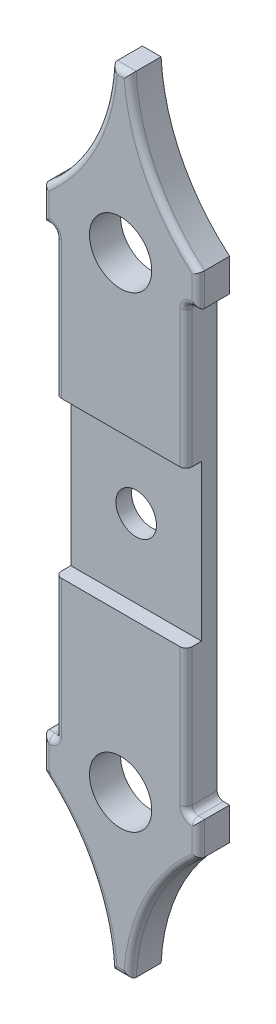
ISO-10303-21;
HEADER;
FILE_DESCRIPTION(('STEP AP214'),'2;1');
FILE_NAME('part.step','',(''),(''),'','','');
FILE_SCHEMA(('AUTOMOTIVE_DESIGN { 1 0 10303 214 1 1 1 1 }'));
ENDSEC;
DATA;
#1=APPLICATION_CONTEXT('core data for automotive mechanical design processes');
#2=APPLICATION_PROTOCOL_DEFINITION('international standard','automotive_design',2000,#1);
#3=PRODUCT_CONTEXT('',#1,'mechanical');
#4=PRODUCT('Part','Part','',(#3));
#5=PRODUCT_RELATED_PRODUCT_CATEGORY('part','',(#4));
#6=PRODUCT_DEFINITION_FORMATION('','',#4);
#7=PRODUCT_DEFINITION_CONTEXT('part definition',#1,'design');
#8=PRODUCT_DEFINITION('design','',#6,#7);
#9=PRODUCT_DEFINITION_SHAPE('','',#8);
#10=(LENGTH_UNIT() NAMED_UNIT(*) SI_UNIT(.MILLI.,.METRE.));
#11=(NAMED_UNIT(*) PLANE_ANGLE_UNIT() SI_UNIT($,.RADIAN.));
#12=(NAMED_UNIT(*) SI_UNIT($,.STERADIAN.) SOLID_ANGLE_UNIT());
#13=UNCERTAINTY_MEASURE_WITH_UNIT(LENGTH_MEASURE(1.E-05),#10,'distance_accuracy_value','');
#14=(GEOMETRIC_REPRESENTATION_CONTEXT(3) GLOBAL_UNCERTAINTY_ASSIGNED_CONTEXT((#13)) GLOBAL_UNIT_ASSIGNED_CONTEXT((#10,
#11,#12)) REPRESENTATION_CONTEXT('',''));
#15=CARTESIAN_POINT('',(0.,0.,0.));
#16=DIRECTION('',(0.,0.,1.));
#17=DIRECTION('',(1.,0.,0.));
#18=AXIS2_PLACEMENT_3D('',#15,#16,#17);
#19=CARTESIAN_POINT('',(65.4177134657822,4.20609508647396,5.));
#20=DIRECTION('',(0.,0.,1.));
#21=DIRECTION('',(1.,0.,0.));
#22=AXIS2_PLACEMENT_3D('',#19,#20,#21);
#23=PLANE('',#22);
#24=CARTESIAN_POINT('',(0.,-125.,5.));
#25=DIRECTION('',(0.,0.,1.));
#26=DIRECTION('',(1.,0.,0.));
#27=AXIS2_PLACEMENT_3D('',#24,#25,#26);
#28=CIRCLE('',#27,6.5);
#29=CARTESIAN_POINT('',(6.5,-125.,5.));
#30=VERTEX_POINT('',#29);
#31=EDGE_CURVE('E1221',#30,#30,#28,.T.);
#32=ORIENTED_EDGE('',*,*,#31,.F.);
#33=EDGE_LOOP('',(#32));
#34=FACE_BOUND('',#33,.T.);
#35=DIRECTION('',(0.,-1.,0.));
#36=VECTOR('',#35,1.);
#37=CARTESIAN_POINT('',(-21.0000000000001,-196.063687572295,5.));
#38=LINE('',#37,#36);
#39=CARTESIAN_POINT('',(-21.,-100.,5.));
#40=VERTEX_POINT('',#39);
#41=CARTESIAN_POINT('',(-21.,-150.,5.));
#42=VERTEX_POINT('',#41);
#43=EDGE_CURVE('E258',#40,#42,#38,.T.);
#44=ORIENTED_EDGE('',*,*,#43,.T.);
#45=DIRECTION('',(-1.,0.,0.));
#46=VECTOR('',#45,1.);
#47=CARTESIAN_POINT('',(-21.,-150.,5.));
#48=LINE('',#47,#46);
#49=CARTESIAN_POINT('',(21.,-150.,5.));
#50=VERTEX_POINT('',#49);
#51=EDGE_CURVE('E267',#50,#42,#48,.T.);
#52=ORIENTED_EDGE('',*,*,#51,.F.);
#53=DIRECTION('',(0.,1.,0.));
#54=VECTOR('',#53,1.);
#55=CARTESIAN_POINT('',(21.,-196.063687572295,5.));
#56=LINE('',#55,#54);
#57=CARTESIAN_POINT('',(21.,-100.,5.));
#58=VERTEX_POINT('',#57);
#59=EDGE_CURVE('E280',#50,#58,#56,.T.);
#60=ORIENTED_EDGE('',*,*,#59,.T.);
#61=DIRECTION('',(1.,0.,0.));
#62=VECTOR('',#61,1.);
#63=CARTESIAN_POINT('',(-21.,-100.,5.));
#64=LINE('',#63,#62);
#65=EDGE_CURVE('E278',#40,#58,#64,.T.);
#66=ORIENTED_EDGE('',*,*,#65,.F.);
#67=EDGE_LOOP('',(#44,#52,#60,#66));
#68=FACE_BOUND('',#67,.T.);
#69=ADVANCED_FACE('F32',(#34,#68),#23,.T.);
#70=CARTESIAN_POINT('',(21.,-196.063687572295,5.));
#71=DIRECTION('',(-1.,0.,0.));
#72=DIRECTION('',(0.,-1.,0.));
#73=AXIS2_PLACEMENT_3D('',#70,#71,#72);
#74=PLANE('',#73);
#75=DIRECTION('',(0.,0.,-1.));
#76=VECTOR('',#75,1.);
#77=CARTESIAN_POINT('',(21.,-150.,10.));
#78=LINE('',#77,#76);
#79=CARTESIAN_POINT('',(21.,-150.,8.));
#80=VERTEX_POINT('',#79);
#81=EDGE_CURVE('E263',#80,#50,#78,.T.);
#82=ORIENTED_EDGE('',*,*,#81,.F.);
#83=DIRECTION('',(0.,1.,0.));
#84=VECTOR('',#83,1.);
#85=CARTESIAN_POINT('',(21.,-196.063687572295,8.));
#86=LINE('',#85,#84);
#87=CARTESIAN_POINT('',(21.,-194.063687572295,8.));
#88=VERTEX_POINT('',#87);
#89=EDGE_CURVE('E637',#80,#88,#86,.F.);
#90=ORIENTED_EDGE('',*,*,#89,.T.);
#91=DIRECTION('',(0.,0.,-1.));
#92=VECTOR('',#91,1.);
#93=CARTESIAN_POINT('',(21.,-194.063687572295,0.));
#94=LINE('',#93,#92);
#95=CARTESIAN_POINT('',(21.,-194.063687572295,0.));
#96=VERTEX_POINT('',#95);
#97=EDGE_CURVE('E636',#88,#96,#94,.T.);
#98=ORIENTED_EDGE('',*,*,#97,.T.);
#99=DIRECTION('',(0.,1.,0.));
#100=VECTOR('',#99,1.);
#101=CARTESIAN_POINT('',(21.,-196.063687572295,0.));
#102=LINE('',#101,#100);
#103=CARTESIAN_POINT('',(21.,-55.9363124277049,0.));
#104=VERTEX_POINT('',#103);
#105=EDGE_CURVE('E297',#96,#104,#102,.T.);
#106=ORIENTED_EDGE('',*,*,#105,.T.);
#107=DIRECTION('',(0.,0.,-1.));
#108=VECTOR('',#107,1.);
#109=CARTESIAN_POINT('',(21.,-55.9363124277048,10.));
#110=LINE('',#109,#108);
#111=CARTESIAN_POINT('',(21.,-55.9363124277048,8.));
#112=VERTEX_POINT('',#111);
#113=EDGE_CURVE('E397',#104,#112,#110,.F.);
#114=ORIENTED_EDGE('',*,*,#113,.T.);
#115=DIRECTION('',(0.,1.,0.));
#116=VECTOR('',#115,1.);
#117=CARTESIAN_POINT('',(21.,-100.,8.));
#118=LINE('',#117,#116);
#119=CARTESIAN_POINT('',(21.,-100.,8.));
#120=VERTEX_POINT('',#119);
#121=EDGE_CURVE('E633',#112,#120,#118,.F.);
#122=ORIENTED_EDGE('',*,*,#121,.T.);
#123=DIRECTION('',(0.,0.,-1.));
#124=VECTOR('',#123,1.);
#125=CARTESIAN_POINT('',(21.,-100.,10.));
#126=LINE('',#125,#124);
#127=EDGE_CURVE('E398',#120,#58,#126,.T.);
#128=ORIENTED_EDGE('',*,*,#127,.T.);
#129=ORIENTED_EDGE('',*,*,#59,.F.);
#130=EDGE_LOOP('',(#82,#90,#98,#106,#114,#122,#128,#129));
#131=FACE_BOUND('',#130,.T.);
#132=ADVANCED_FACE('F748',(#131),#74,.F.);
#133=CARTESIAN_POINT('',(25.,-53.9363124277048,5.));
#134=DIRECTION('',(0.,1.,0.));
#135=DIRECTION('',(-1.,0.,0.));
#136=AXIS2_PLACEMENT_3D('',#133,#134,#135);
#137=PLANE('',#136);
#138=DIRECTION('',(0.,0.,-1.));
#139=VECTOR('',#138,1.);
#140=CARTESIAN_POINT('',(25.,-53.9363124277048,5.));
#141=LINE('',#140,#139);
#142=CARTESIAN_POINT('',(25.,-53.9363124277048,8.));
#143=VERTEX_POINT('',#142);
#144=CARTESIAN_POINT('',(25.,-53.9363124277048,0.));
#145=VERTEX_POINT('',#144);
#146=EDGE_CURVE('E289',#143,#145,#141,.T.);
#147=ORIENTED_EDGE('',*,*,#146,.F.);
#148=DIRECTION('',(1.,0.,0.));
#149=VECTOR('',#148,1.);
#150=CARTESIAN_POINT('',(21.,-53.9363124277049,8.));
#151=LINE('',#150,#149);
#152=CARTESIAN_POINT('',(23.,-53.9363124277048,8.));
#153=VERTEX_POINT('',#152);
#154=EDGE_CURVE('E49',#143,#153,#151,.F.);
#155=ORIENTED_EDGE('',*,*,#154,.T.);
#156=DIRECTION('',(0.,0.,-1.));
#157=VECTOR('',#156,1.);
#158=CARTESIAN_POINT('',(23.,-53.9363124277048,0.));
#159=LINE('',#158,#157);
#160=CARTESIAN_POINT('',(23.,-53.9363124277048,0.));
#161=VERTEX_POINT('',#160);
#162=EDGE_CURVE('E53',#153,#161,#159,.T.);
#163=ORIENTED_EDGE('',*,*,#162,.T.);
#164=DIRECTION('',(1.,0.,0.));
#165=VECTOR('',#164,1.);
#166=CARTESIAN_POINT('',(25.,-53.9363124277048,0.));
#167=LINE('',#166,#165);
#168=EDGE_CURVE('E300',#161,#145,#167,.T.);
#169=ORIENTED_EDGE('',*,*,#168,.T.);
#170=EDGE_LOOP('',(#147,#155,#163,#169));
#171=FACE_BOUND('',#170,.T.);
#172=ADVANCED_FACE('F775',(#171),#137,.F.);
#173=CARTESIAN_POINT('',(25.,-53.9363124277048,5.));
#174=DIRECTION('',(-1.,0.,0.));
#175=DIRECTION('',(0.,0.,1.));
#176=AXIS2_PLACEMENT_3D('',#173,#174,#175);
#177=PLANE('',#176);
#178=DIRECTION('',(0.,0.,-1.));
#179=VECTOR('',#178,1.);
#180=CARTESIAN_POINT('',(25.,-43.4663124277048,5.));
#181=LINE('',#180,#179);
#182=CARTESIAN_POINT('',(25.,-43.4663124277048,8.));
#183=VERTEX_POINT('',#182);
#184=CARTESIAN_POINT('',(25.,-43.4663124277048,0.));
#185=VERTEX_POINT('',#184);
#186=EDGE_CURVE('E360',#183,#185,#181,.T.);
#187=ORIENTED_EDGE('',*,*,#186,.F.);
#188=DIRECTION('',(0.,1.,0.));
#189=VECTOR('',#188,1.);
#190=CARTESIAN_POINT('',(25.,-53.9363124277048,8.));
#191=LINE('',#190,#189);
#192=EDGE_CURVE('E450',#183,#143,#191,.F.);
#193=ORIENTED_EDGE('',*,*,#192,.T.);
#194=ORIENTED_EDGE('',*,*,#146,.T.);
#195=DIRECTION('',(0.,1.,0.));
#196=VECTOR('',#195,1.);
#197=CARTESIAN_POINT('',(25.,-53.9363124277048,0.));
#198=LINE('',#197,#196);
#199=EDGE_CURVE('E303',#145,#185,#198,.T.);
#200=ORIENTED_EDGE('',*,*,#199,.T.);
#201=EDGE_LOOP('',(#187,#193,#194,#200));
#202=FACE_BOUND('',#201,.T.);
#203=ADVANCED_FACE('F710',(#202),#177,.F.);
#204=CARTESIAN_POINT('',(65.4177134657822,4.20609508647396,5.));
#205=DIRECTION('',(0.,0.,-1.));
#206=DIRECTION('',(-1.,0.,0.));
#207=AXIS2_PLACEMENT_3D('',#204,#205,#206);
#208=CYLINDRICAL_SURFACE('',#207,62.5);
#209=DIRECTION('',(0.,0.,-1.));
#210=VECTOR('',#209,1.);
#211=CARTESIAN_POINT('',(3.00000000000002,1.00000000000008,5.));
#212=LINE('',#211,#210);
#213=CARTESIAN_POINT('',(3.00000000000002,1.00000000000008,8.));
#214=VERTEX_POINT('',#213);
#215=CARTESIAN_POINT('',(3.00000000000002,1.00000000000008,0.));
#216=VERTEX_POINT('',#215);
#217=EDGE_CURVE('E359',#214,#216,#212,.T.);
#218=ORIENTED_EDGE('',*,*,#217,.F.);
#219=CARTESIAN_POINT('',(65.4177134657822,4.20609508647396,8.));
#220=DIRECTION('',(0.,0.,1.));
#221=DIRECTION('',(1.,0.,0.));
#222=AXIS2_PLACEMENT_3D('',#219,#220,#221);
#223=CIRCLE('',#222,62.5);
#224=EDGE_CURVE('E448',#214,#183,#223,.T.);
#225=ORIENTED_EDGE('',*,*,#224,.T.);
#226=ORIENTED_EDGE('',*,*,#186,.T.);
#227=CARTESIAN_POINT('',(65.4177134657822,4.20609508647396,0.));
#228=DIRECTION('',(0.,0.,-1.));
#229=DIRECTION('',(1.,0.,0.));
#230=AXIS2_PLACEMENT_3D('',#227,#228,#229);
#231=CIRCLE('',#230,62.5);
#232=EDGE_CURVE('E306',#185,#216,#231,.T.);
#233=ORIENTED_EDGE('',*,*,#232,.T.);
#234=EDGE_LOOP('',(#218,#225,#226,#233));
#235=FACE_BOUND('',#234,.T.);
#236=ADVANCED_FACE('F709',(#235),#208,.F.);
#237=CARTESIAN_POINT('',(3.00000000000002,1.00000000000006,5.));
#238=DIRECTION('',(0.,-1.,0.));
#239=DIRECTION('',(0.,0.,-1.));
#240=AXIS2_PLACEMENT_3D('',#237,#238,#239);
#241=PLANE('',#240);
#242=DIRECTION('',(0.,0.,-1.));
#243=VECTOR('',#242,1.);
#244=CARTESIAN_POINT('',(-2.99999999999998,1.00000000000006,5.));
#245=LINE('',#244,#243);
#246=CARTESIAN_POINT('',(-2.99999999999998,1.00000000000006,8.));
#247=VERTEX_POINT('',#246);
#248=CARTESIAN_POINT('',(-2.99999999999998,1.00000000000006,0.));
#249=VERTEX_POINT('',#248);
#250=EDGE_CURVE('E357',#247,#249,#245,.T.);
#251=ORIENTED_EDGE('',*,*,#250,.F.);
#252=DIRECTION('',(-1.,0.,0.));
#253=VECTOR('',#252,1.);
#254=CARTESIAN_POINT('',(3.00000000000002,1.00000000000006,8.));
#255=LINE('',#254,#253);
#256=EDGE_CURVE('E446',#247,#214,#255,.F.);
#257=ORIENTED_EDGE('',*,*,#256,.T.);
#258=ORIENTED_EDGE('',*,*,#217,.T.);
#259=DIRECTION('',(-1.,0.,0.));
#260=VECTOR('',#259,1.);
#261=CARTESIAN_POINT('',(3.00000000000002,1.00000000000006,0.));
#262=LINE('',#261,#260);
#263=EDGE_CURVE('E309',#216,#249,#262,.T.);
#264=ORIENTED_EDGE('',*,*,#263,.T.);
#265=EDGE_LOOP('',(#251,#257,#258,#264));
#266=FACE_BOUND('',#265,.T.);
#267=ADVANCED_FACE('F702',(#266),#241,.F.);
#268=CARTESIAN_POINT('',(-65.4177134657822,4.20609508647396,5.));
#269=DIRECTION('',(0.,0.,-1.));
#270=DIRECTION('',(-1.,0.,0.));
#271=AXIS2_PLACEMENT_3D('',#268,#269,#270);
#272=CYLINDRICAL_SURFACE('',#271,62.5);
#273=DIRECTION('',(0.,0.,-1.));
#274=VECTOR('',#273,1.);
#275=CARTESIAN_POINT('',(-25.,-43.4663124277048,5.));
#276=LINE('',#275,#274);
#277=CARTESIAN_POINT('',(-25.,-43.4663124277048,8.));
#278=VERTEX_POINT('',#277);
#279=CARTESIAN_POINT('',(-25.,-43.4663124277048,0.));
#280=VERTEX_POINT('',#279);
#281=EDGE_CURVE('E355',#278,#280,#276,.T.);
#282=ORIENTED_EDGE('',*,*,#281,.F.);
#283=CARTESIAN_POINT('',(-65.4177134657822,4.20609508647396,8.));
#284=DIRECTION('',(0.,0.,1.));
#285=DIRECTION('',(1.,0.,0.));
#286=AXIS2_PLACEMENT_3D('',#283,#284,#285);
#287=CIRCLE('',#286,62.5);
#288=EDGE_CURVE('E444',#278,#247,#287,.T.);
#289=ORIENTED_EDGE('',*,*,#288,.T.);
#290=ORIENTED_EDGE('',*,*,#250,.T.);
#291=CARTESIAN_POINT('',(-65.4177134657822,4.20609508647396,0.));
#292=DIRECTION('',(0.,0.,-1.));
#293=DIRECTION('',(-1.,0.,0.));
#294=AXIS2_PLACEMENT_3D('',#291,#292,#293);
#295=CIRCLE('',#294,62.5);
#296=EDGE_CURVE('E312',#249,#280,#295,.T.);
#297=ORIENTED_EDGE('',*,*,#296,.T.);
#298=EDGE_LOOP('',(#282,#289,#290,#297));
#299=FACE_BOUND('',#298,.T.);
#300=ADVANCED_FACE('F699',(#299),#272,.F.);
#301=CARTESIAN_POINT('',(-25.,-53.9363124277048,5.));
#302=DIRECTION('',(1.,0.,0.));
#303=DIRECTION('',(0.,0.,-1.));
#304=AXIS2_PLACEMENT_3D('',#301,#302,#303);
#305=PLANE('',#304);
#306=DIRECTION('',(0.,0.,-1.));
#307=VECTOR('',#306,1.);
#308=CARTESIAN_POINT('',(-25.,-53.9363124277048,5.));
#309=LINE('',#308,#307);
#310=CARTESIAN_POINT('',(-25.,-53.9363124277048,8.));
#311=VERTEX_POINT('',#310);
#312=CARTESIAN_POINT('',(-25.,-53.9363124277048,0.));
#313=VERTEX_POINT('',#312);
#314=EDGE_CURVE('E353',#311,#313,#309,.T.);
#315=ORIENTED_EDGE('',*,*,#314,.F.);
#316=DIRECTION('',(0.,-1.,0.));
#317=VECTOR('',#316,1.);
#318=CARTESIAN_POINT('',(-25.,-43.4663124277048,8.));
#319=LINE('',#318,#317);
#320=EDGE_CURVE('E442',#311,#278,#319,.F.);
#321=ORIENTED_EDGE('',*,*,#320,.T.);
#322=ORIENTED_EDGE('',*,*,#281,.T.);
#323=DIRECTION('',(0.,-1.,0.));
#324=VECTOR('',#323,1.);
#325=CARTESIAN_POINT('',(-25.,-53.9363124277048,0.));
#326=LINE('',#325,#324);
#327=EDGE_CURVE('E315',#280,#313,#326,.T.);
#328=ORIENTED_EDGE('',*,*,#327,.T.);
#329=EDGE_LOOP('',(#315,#321,#322,#328));
#330=FACE_BOUND('',#329,.T.);
#331=ADVANCED_FACE('F719',(#330),#305,.F.);
#332=CARTESIAN_POINT('',(-21.,-53.9363124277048,5.));
#333=DIRECTION('',(0.,1.,0.));
#334=DIRECTION('',(0.,0.,1.));
#335=AXIS2_PLACEMENT_3D('',#332,#333,#334);
#336=PLANE('',#335);
#337=DIRECTION('',(0.,0.,-1.));
#338=VECTOR('',#337,1.);
#339=CARTESIAN_POINT('',(-23.,-53.9363124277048,10.));
#340=LINE('',#339,#338);
#341=CARTESIAN_POINT('',(-23.,-53.9363124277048,0.));
#342=VERTEX_POINT('',#341);
#343=CARTESIAN_POINT('',(-23.,-53.9363124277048,8.));
#344=VERTEX_POINT('',#343);
#345=EDGE_CURVE('E437',#342,#344,#340,.F.);
#346=ORIENTED_EDGE('',*,*,#345,.T.);
#347=DIRECTION('',(1.,0.,0.));
#348=VECTOR('',#347,1.);
#349=CARTESIAN_POINT('',(-25.,-53.9363124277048,8.));
#350=LINE('',#349,#348);
#351=EDGE_CURVE('E439',#344,#311,#350,.F.);
#352=ORIENTED_EDGE('',*,*,#351,.T.);
#353=ORIENTED_EDGE('',*,*,#314,.T.);
#354=DIRECTION('',(1.,0.,0.));
#355=VECTOR('',#354,1.);
#356=CARTESIAN_POINT('',(-21.,-53.9363124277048,0.));
#357=LINE('',#356,#355);
#358=EDGE_CURVE('E318',#313,#342,#357,.T.);
#359=ORIENTED_EDGE('',*,*,#358,.T.);
#360=EDGE_LOOP('',(#346,#352,#353,#359));
#361=FACE_BOUND('',#360,.T.);
#362=ADVANCED_FACE('F721',(#361),#336,.F.);
#363=CARTESIAN_POINT('',(-21.0000000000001,-196.063687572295,5.));
#364=DIRECTION('',(1.,0.,0.));
#365=DIRECTION('',(0.,1.,0.));
#366=AXIS2_PLACEMENT_3D('',#363,#364,#365);
#367=PLANE('',#366);
#368=DIRECTION('',(0.,0.,-1.));
#369=VECTOR('',#368,1.);
#370=CARTESIAN_POINT('',(-21.0000000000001,-194.063687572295,10.));
#371=LINE('',#370,#369);
#372=CARTESIAN_POINT('',(-21.0000000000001,-194.063687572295,0.));
#373=VERTEX_POINT('',#372);
#374=CARTESIAN_POINT('',(-21.0000000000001,-194.063687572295,8.));
#375=VERTEX_POINT('',#374);
#376=EDGE_CURVE('E414',#373,#375,#371,.F.);
#377=ORIENTED_EDGE('',*,*,#376,.T.);
#378=DIRECTION('',(0.,-1.,0.));
#379=VECTOR('',#378,1.);
#380=CARTESIAN_POINT('',(-21.0000000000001,-196.063687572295,8.));
#381=LINE('',#380,#379);
#382=CARTESIAN_POINT('',(-21.,-150.,8.));
#383=VERTEX_POINT('',#382);
#384=EDGE_CURVE('E260',#375,#383,#381,.F.);
#385=ORIENTED_EDGE('',*,*,#384,.T.);
#386=DIRECTION('',(0.,0.,-1.));
#387=VECTOR('',#386,1.);
#388=CARTESIAN_POINT('',(-21.,-150.,10.));
#389=LINE('',#388,#387);
#390=EDGE_CURVE('E253',#383,#42,#389,.T.);
#391=ORIENTED_EDGE('',*,*,#390,.T.);
#392=ORIENTED_EDGE('',*,*,#43,.F.);
#393=DIRECTION('',(0.,0.,-1.));
#394=VECTOR('',#393,1.);
#395=CARTESIAN_POINT('',(-21.,-100.,10.));
#396=LINE('',#395,#394);
#397=CARTESIAN_POINT('',(-21.,-100.,8.));
#398=VERTEX_POINT('',#397);
#399=EDGE_CURVE('E301',#398,#40,#396,.T.);
#400=ORIENTED_EDGE('',*,*,#399,.F.);
#401=DIRECTION('',(0.,-1.,0.));
#402=VECTOR('',#401,1.);
#403=CARTESIAN_POINT('',(-21.,-53.9363124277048,8.));
#404=LINE('',#403,#402);
#405=CARTESIAN_POINT('',(-21.,-55.9363124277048,8.));
#406=VERTEX_POINT('',#405);
#407=EDGE_CURVE('E412',#398,#406,#404,.F.);
#408=ORIENTED_EDGE('',*,*,#407,.T.);
#409=DIRECTION('',(0.,0.,-1.));
#410=VECTOR('',#409,1.);
#411=CARTESIAN_POINT('',(-21.,-55.9363124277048,0.));
#412=LINE('',#411,#410);
#413=CARTESIAN_POINT('',(-21.,-55.9363124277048,0.));
#414=VERTEX_POINT('',#413);
#415=EDGE_CURVE('E410',#406,#414,#412,.T.);
#416=ORIENTED_EDGE('',*,*,#415,.T.);
#417=DIRECTION('',(0.,-1.,0.));
#418=VECTOR('',#417,1.);
#419=CARTESIAN_POINT('',(-21.0000000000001,-196.063687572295,0.));
#420=LINE('',#419,#418);
#421=EDGE_CURVE('E321',#414,#373,#420,.T.);
#422=ORIENTED_EDGE('',*,*,#421,.T.);
#423=EDGE_LOOP('',(#377,#385,#391,#392,#400,#408,#416,#422));
#424=FACE_BOUND('',#423,.T.);
#425=ADVANCED_FACE('F255',(#424),#367,.F.);
#426=CARTESIAN_POINT('',(-21.0000000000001,-196.063687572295,5.));
#427=DIRECTION('',(0.,-1.,0.));
#428=DIRECTION('',(0.,0.,-1.));
#429=AXIS2_PLACEMENT_3D('',#426,#427,#428);
#430=PLANE('',#429);
#431=DIRECTION('',(0.,0.,-1.));
#432=VECTOR('',#431,1.);
#433=CARTESIAN_POINT('',(-25.,-196.063687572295,5.));
#434=LINE('',#433,#432);
#435=CARTESIAN_POINT('',(-25.,-196.063687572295,8.));
#436=VERTEX_POINT('',#435);
#437=CARTESIAN_POINT('',(-25.,-196.063687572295,0.));
#438=VERTEX_POINT('',#437);
#439=EDGE_CURVE('E350',#436,#438,#434,.T.);
#440=ORIENTED_EDGE('',*,*,#439,.F.);
#441=DIRECTION('',(-1.,0.,0.));
#442=VECTOR('',#441,1.);
#443=CARTESIAN_POINT('',(-21.0000000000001,-196.063687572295,8.));
#444=LINE('',#443,#442);
#445=CARTESIAN_POINT('',(-23.0000000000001,-196.063687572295,8.));
#446=VERTEX_POINT('',#445);
#447=EDGE_CURVE('E408',#436,#446,#444,.F.);
#448=ORIENTED_EDGE('',*,*,#447,.T.);
#449=DIRECTION('',(0.,0.,-1.));
#450=VECTOR('',#449,1.);
#451=CARTESIAN_POINT('',(-23.0000000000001,-196.063687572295,0.));
#452=LINE('',#451,#450);
#453=CARTESIAN_POINT('',(-23.0000000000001,-196.063687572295,0.));
#454=VERTEX_POINT('',#453);
#455=EDGE_CURVE('E654',#446,#454,#452,.T.);
#456=ORIENTED_EDGE('',*,*,#455,.T.);
#457=DIRECTION('',(-1.,0.,0.));
#458=VECTOR('',#457,1.);
#459=CARTESIAN_POINT('',(-21.0000000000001,-196.063687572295,0.));
#460=LINE('',#459,#458);
#461=EDGE_CURVE('E324',#454,#438,#460,.T.);
#462=ORIENTED_EDGE('',*,*,#461,.T.);
#463=EDGE_LOOP('',(#440,#448,#456,#462));
#464=FACE_BOUND('',#463,.T.);
#465=ADVANCED_FACE('F660',(#464),#430,.F.);
#466=CARTESIAN_POINT('',(-25.,-196.063687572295,5.));
#467=DIRECTION('',(1.,0.,0.));
#468=DIRECTION('',(0.,1.,0.));
#469=AXIS2_PLACEMENT_3D('',#466,#467,#468);
#470=PLANE('',#469);
#471=DIRECTION('',(0.,0.,-1.));
#472=VECTOR('',#471,1.);
#473=CARTESIAN_POINT('',(-25.,-206.533687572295,5.));
#474=LINE('',#473,#472);
#475=CARTESIAN_POINT('',(-25.,-206.533687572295,8.));
#476=VERTEX_POINT('',#475);
#477=CARTESIAN_POINT('',(-25.,-206.533687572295,0.));
#478=VERTEX_POINT('',#477);
#479=EDGE_CURVE('E348',#476,#478,#474,.T.);
#480=ORIENTED_EDGE('',*,*,#479,.F.);
#481=DIRECTION('',(0.,-1.,0.));
#482=VECTOR('',#481,1.);
#483=CARTESIAN_POINT('',(-25.,-196.063687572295,8.));
#484=LINE('',#483,#482);
#485=EDGE_CURVE('E653',#476,#436,#484,.F.);
#486=ORIENTED_EDGE('',*,*,#485,.T.);
#487=ORIENTED_EDGE('',*,*,#439,.T.);
#488=DIRECTION('',(0.,-1.,0.));
#489=VECTOR('',#488,1.);
#490=CARTESIAN_POINT('',(-25.,-196.063687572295,0.));
#491=LINE('',#490,#489);
#492=EDGE_CURVE('E326',#438,#478,#491,.T.);
#493=ORIENTED_EDGE('',*,*,#492,.T.);
#494=EDGE_LOOP('',(#480,#486,#487,#493));
#495=FACE_BOUND('',#494,.T.);
#496=ADVANCED_FACE('F803',(#495),#470,.F.);
#497=CARTESIAN_POINT('',(-65.4177134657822,-254.206095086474,5.));
#498=DIRECTION('',(0.,0.,-1.));
#499=DIRECTION('',(-1.,0.,0.));
#500=AXIS2_PLACEMENT_3D('',#497,#498,#499);
#501=CYLINDRICAL_SURFACE('',#500,62.5);
#502=DIRECTION('',(0.,0.,-1.));
#503=VECTOR('',#502,1.);
#504=CARTESIAN_POINT('',(-3.00000000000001,-251.,5.));
#505=LINE('',#504,#503);
#506=CARTESIAN_POINT('',(-3.00000000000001,-251.,8.));
#507=VERTEX_POINT('',#506);
#508=CARTESIAN_POINT('',(-3.00000000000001,-251.,0.));
#509=VERTEX_POINT('',#508);
#510=EDGE_CURVE('E346',#507,#509,#505,.T.);
#511=ORIENTED_EDGE('',*,*,#510,.F.);
#512=CARTESIAN_POINT('',(-65.4177134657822,-254.206095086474,8.));
#513=DIRECTION('',(0.,0.,-1.));
#514=DIRECTION('',(-1.,0.,0.));
#515=AXIS2_PLACEMENT_3D('',#512,#513,#514);
#516=CIRCLE('',#515,62.5);
#517=EDGE_CURVE('E651',#507,#476,#516,.F.);
#518=ORIENTED_EDGE('',*,*,#517,.T.);
#519=ORIENTED_EDGE('',*,*,#479,.T.);
#520=CARTESIAN_POINT('',(-65.4177134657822,-254.206095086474,0.));
#521=DIRECTION('',(0.,0.,-1.));
#522=DIRECTION('',(1.,0.,0.));
#523=AXIS2_PLACEMENT_3D('',#520,#521,#522);
#524=CIRCLE('',#523,62.5);
#525=EDGE_CURVE('E329',#478,#509,#524,.T.);
#526=ORIENTED_EDGE('',*,*,#525,.T.);
#527=EDGE_LOOP('',(#511,#518,#519,#526));
#528=FACE_BOUND('',#527,.T.);
#529=ADVANCED_FACE('F799',(#528),#501,.F.);
#530=CARTESIAN_POINT('',(2.99999999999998,-251.,5.));
#531=DIRECTION('',(0.,1.,0.));
#532=DIRECTION('',(0.,0.,1.));
#533=AXIS2_PLACEMENT_3D('',#530,#531,#532);
#534=PLANE('',#533);
#535=DIRECTION('',(0.,0.,-1.));
#536=VECTOR('',#535,1.);
#537=CARTESIAN_POINT('',(2.99999999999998,-251.,5.));
#538=LINE('',#537,#536);
#539=CARTESIAN_POINT('',(2.99999999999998,-251.,8.));
#540=VERTEX_POINT('',#539);
#541=CARTESIAN_POINT('',(2.99999999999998,-251.,0.));
#542=VERTEX_POINT('',#541);
#543=EDGE_CURVE('E344',#540,#542,#538,.T.);
#544=ORIENTED_EDGE('',*,*,#543,.F.);
#545=DIRECTION('',(1.,0.,0.));
#546=VECTOR('',#545,1.);
#547=CARTESIAN_POINT('',(2.99999999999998,-251.,8.));
#548=LINE('',#547,#546);
#549=EDGE_CURVE('E649',#540,#507,#548,.F.);
#550=ORIENTED_EDGE('',*,*,#549,.T.);
#551=ORIENTED_EDGE('',*,*,#510,.T.);
#552=DIRECTION('',(1.,0.,0.));
#553=VECTOR('',#552,1.);
#554=CARTESIAN_POINT('',(2.99999999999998,-251.,0.));
#555=LINE('',#554,#553);
#556=EDGE_CURVE('E332',#509,#542,#555,.T.);
#557=ORIENTED_EDGE('',*,*,#556,.T.);
#558=EDGE_LOOP('',(#544,#550,#551,#557));
#559=FACE_BOUND('',#558,.T.);
#560=ADVANCED_FACE('F795',(#559),#534,.F.);
#561=CARTESIAN_POINT('',(65.4177134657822,-254.206095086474,5.));
#562=DIRECTION('',(0.,0.,-1.));
#563=DIRECTION('',(-1.,0.,0.));
#564=AXIS2_PLACEMENT_3D('',#561,#562,#563);
#565=CYLINDRICAL_SURFACE('',#564,62.5);
#566=DIRECTION('',(0.,0.,-1.));
#567=VECTOR('',#566,1.);
#568=CARTESIAN_POINT('',(25.,-206.533687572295,5.));
#569=LINE('',#568,#567);
#570=CARTESIAN_POINT('',(25.,-206.533687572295,8.));
#571=VERTEX_POINT('',#570);
#572=CARTESIAN_POINT('',(25.,-206.533687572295,0.));
#573=VERTEX_POINT('',#572);
#574=EDGE_CURVE('E282',#571,#573,#569,.T.);
#575=ORIENTED_EDGE('',*,*,#574,.F.);
#576=CARTESIAN_POINT('',(65.4177134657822,-254.206095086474,8.));
#577=DIRECTION('',(0.,0.,-1.));
#578=DIRECTION('',(-1.,0.,0.));
#579=AXIS2_PLACEMENT_3D('',#576,#577,#578);
#580=CIRCLE('',#579,62.5);
#581=EDGE_CURVE('E647',#571,#540,#580,.F.);
#582=ORIENTED_EDGE('',*,*,#581,.T.);
#583=ORIENTED_EDGE('',*,*,#543,.T.);
#584=CARTESIAN_POINT('',(65.4177134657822,-254.206095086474,0.));
#585=DIRECTION('',(0.,0.,-1.));
#586=DIRECTION('',(-1.,0.,0.));
#587=AXIS2_PLACEMENT_3D('',#584,#585,#586);
#588=CIRCLE('',#587,62.5);
#589=EDGE_CURVE('E335',#542,#573,#588,.T.);
#590=ORIENTED_EDGE('',*,*,#589,.T.);
#591=EDGE_LOOP('',(#575,#582,#583,#590));
#592=FACE_BOUND('',#591,.T.);
#593=ADVANCED_FACE('F791',(#592),#565,.F.);
#594=CARTESIAN_POINT('',(25.,-196.063687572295,5.));
#595=DIRECTION('',(-1.,0.,0.));
#596=DIRECTION('',(0.,0.,1.));
#597=AXIS2_PLACEMENT_3D('',#594,#595,#596);
#598=PLANE('',#597);
#599=DIRECTION('',(0.,0.,-1.));
#600=VECTOR('',#599,1.);
#601=CARTESIAN_POINT('',(25.,-196.063687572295,5.));
#602=LINE('',#601,#600);
#603=CARTESIAN_POINT('',(25.,-196.063687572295,8.));
#604=VERTEX_POINT('',#603);
#605=CARTESIAN_POINT('',(25.,-196.063687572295,0.));
#606=VERTEX_POINT('',#605);
#607=EDGE_CURVE('E279',#604,#606,#602,.T.);
#608=ORIENTED_EDGE('',*,*,#607,.F.);
#609=DIRECTION('',(0.,1.,0.));
#610=VECTOR('',#609,1.);
#611=CARTESIAN_POINT('',(25.,-196.063687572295,8.));
#612=LINE('',#611,#610);
#613=EDGE_CURVE('E645',#604,#571,#612,.F.);
#614=ORIENTED_EDGE('',*,*,#613,.T.);
#615=ORIENTED_EDGE('',*,*,#574,.T.);
#616=DIRECTION('',(0.,1.,0.));
#617=VECTOR('',#616,1.);
#618=CARTESIAN_POINT('',(25.,-196.063687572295,0.));
#619=LINE('',#618,#617);
#620=EDGE_CURVE('E338',#573,#606,#619,.T.);
#621=ORIENTED_EDGE('',*,*,#620,.T.);
#622=EDGE_LOOP('',(#608,#614,#615,#621));
#623=FACE_BOUND('',#622,.T.);
#624=ADVANCED_FACE('F787',(#623),#598,.F.);
#625=CARTESIAN_POINT('',(25.,-196.063687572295,5.));
#626=DIRECTION('',(0.,-1.,0.));
#627=DIRECTION('',(1.,0.,0.));
#628=AXIS2_PLACEMENT_3D('',#625,#626,#627);
#629=PLANE('',#628);
#630=DIRECTION('',(0.,0.,-1.));
#631=VECTOR('',#630,1.);
#632=CARTESIAN_POINT('',(23.,-196.063687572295,10.));
#633=LINE('',#632,#631);
#634=CARTESIAN_POINT('',(23.,-196.063687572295,0.));
#635=VERTEX_POINT('',#634);
#636=CARTESIAN_POINT('',(23.,-196.063687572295,8.));
#637=VERTEX_POINT('',#636);
#638=EDGE_CURVE('E641',#635,#637,#633,.F.);
#639=ORIENTED_EDGE('',*,*,#638,.T.);
#640=DIRECTION('',(-1.,0.,0.));
#641=VECTOR('',#640,1.);
#642=CARTESIAN_POINT('',(25.,-196.063687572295,8.));
#643=LINE('',#642,#641);
#644=EDGE_CURVE('E643',#637,#604,#643,.F.);
#645=ORIENTED_EDGE('',*,*,#644,.T.);
#646=ORIENTED_EDGE('',*,*,#607,.T.);
#647=DIRECTION('',(-1.,0.,0.));
#648=VECTOR('',#647,1.);
#649=CARTESIAN_POINT('',(25.,-196.063687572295,0.));
#650=LINE('',#649,#648);
#651=EDGE_CURVE('E284',#606,#635,#650,.T.);
#652=ORIENTED_EDGE('',*,*,#651,.T.);
#653=EDGE_LOOP('',(#639,#645,#646,#652));
#654=FACE_BOUND('',#653,.T.);
#655=ADVANCED_FACE('F783',(#654),#629,.F.);
#656=CARTESIAN_POINT('',(65.4177134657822,4.20609508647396,0.));
#657=DIRECTION('',(0.,0.,1.));
#658=DIRECTION('',(1.,0.,0.));
#659=AXIS2_PLACEMENT_3D('',#656,#657,#658);
#660=PLANE('',#659);
#661=CARTESIAN_POINT('',(0.,-200.,0.));
#662=DIRECTION('',(0.,0.,1.));
#663=DIRECTION('',(1.,0.,0.));
#664=AXIS2_PLACEMENT_3D('',#661,#662,#663);
#665=CIRCLE('',#664,10.);
#666=CARTESIAN_POINT('',(10.,-200.,0.));
#667=VERTEX_POINT('',#666);
#668=EDGE_CURVE('E1226',#667,#667,#665,.T.);
#669=ORIENTED_EDGE('',*,*,#668,.T.);
#670=EDGE_LOOP('',(#669));
#671=FACE_BOUND('',#670,.T.);
#672=CARTESIAN_POINT('',(0.,-125.,0.));
#673=DIRECTION('',(0.,0.,1.));
#674=DIRECTION('',(1.,0.,0.));
#675=AXIS2_PLACEMENT_3D('',#672,#673,#674);
#676=CIRCLE('',#675,6.5);
#677=CARTESIAN_POINT('',(6.5,-125.,0.));
#678=VERTEX_POINT('',#677);
#679=EDGE_CURVE('E376',#678,#678,#676,.T.);
#680=ORIENTED_EDGE('',*,*,#679,.T.);
#681=EDGE_LOOP('',(#680));
#682=FACE_BOUND('',#681,.T.);
#683=CARTESIAN_POINT('',(0.,-50.,0.));
#684=DIRECTION('',(0.,0.,1.));
#685=DIRECTION('',(1.,0.,0.));
#686=AXIS2_PLACEMENT_3D('',#683,#684,#685);
#687=CIRCLE('',#686,10.);
#688=CARTESIAN_POINT('',(10.,-50.,0.));
#689=VERTEX_POINT('',#688);
#690=EDGE_CURVE('E274',#689,#689,#687,.T.);
#691=ORIENTED_EDGE('',*,*,#690,.T.);
#692=EDGE_LOOP('',(#691));
#693=FACE_BOUND('',#692,.T.);
#694=ORIENTED_EDGE('',*,*,#105,.F.);
#695=CARTESIAN_POINT('',(23.,-194.063687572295,0.));
#696=DIRECTION('',(0.,0.,1.));
#697=DIRECTION('',(1.,0.,0.));
#698=AXIS2_PLACEMENT_3D('',#695,#696,#697);
#699=CIRCLE('',#698,2.);
#700=EDGE_CURVE('E460',#96,#635,#699,.T.);
#701=ORIENTED_EDGE('',*,*,#700,.T.);
#702=ORIENTED_EDGE('',*,*,#651,.F.);
#703=ORIENTED_EDGE('',*,*,#620,.F.);
#704=ORIENTED_EDGE('',*,*,#589,.F.);
#705=ORIENTED_EDGE('',*,*,#556,.F.);
#706=ORIENTED_EDGE('',*,*,#525,.F.);
#707=ORIENTED_EDGE('',*,*,#492,.F.);
#708=ORIENTED_EDGE('',*,*,#461,.F.);
#709=CARTESIAN_POINT('',(-23.0000000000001,-194.063687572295,0.));
#710=DIRECTION('',(0.,0.,1.));
#711=DIRECTION('',(1.,0.,0.));
#712=AXIS2_PLACEMENT_3D('',#709,#710,#711);
#713=CIRCLE('',#712,2.);
#714=EDGE_CURVE('E458',#454,#373,#713,.T.);
#715=ORIENTED_EDGE('',*,*,#714,.T.);
#716=ORIENTED_EDGE('',*,*,#421,.F.);
#717=CARTESIAN_POINT('',(-23.,-55.9363124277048,0.));
#718=DIRECTION('',(0.,0.,1.));
#719=DIRECTION('',(1.,0.,0.));
#720=AXIS2_PLACEMENT_3D('',#717,#718,#719);
#721=CIRCLE('',#720,2.);
#722=EDGE_CURVE('E11',#414,#342,#721,.T.);
#723=ORIENTED_EDGE('',*,*,#722,.T.);
#724=ORIENTED_EDGE('',*,*,#358,.F.);
#725=ORIENTED_EDGE('',*,*,#327,.F.);
#726=ORIENTED_EDGE('',*,*,#296,.F.);
#727=ORIENTED_EDGE('',*,*,#263,.F.);
#728=ORIENTED_EDGE('',*,*,#232,.F.);
#729=ORIENTED_EDGE('',*,*,#199,.F.);
#730=ORIENTED_EDGE('',*,*,#168,.F.);
#731=CARTESIAN_POINT('',(23.,-55.9363124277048,0.));
#732=DIRECTION('',(0.,0.,1.));
#733=DIRECTION('',(1.,0.,0.));
#734=AXIS2_PLACEMENT_3D('',#731,#732,#733);
#735=CIRCLE('',#734,2.);
#736=EDGE_CURVE('E41',#161,#104,#735,.T.);
#737=ORIENTED_EDGE('',*,*,#736,.T.);
#738=EDGE_LOOP('',(#694,#701,#702,#703,#704,#705,#706,#707,#708,#715,#716,#723,#724,#725,#726,
#727,#728,#729,#730,#737));
#739=FACE_BOUND('',#738,.T.);
#740=ADVANCED_FACE('F714',(#671,#682,#693,#739),#660,.F.);
#741=CARTESIAN_POINT('',(-21.,-100.,10.));
#742=DIRECTION('',(0.,1.,0.));
#743=DIRECTION('',(0.,0.,1.));
#744=AXIS2_PLACEMENT_3D('',#741,#742,#743);
#745=PLANE('',#744);
#746=ORIENTED_EDGE('',*,*,#127,.F.);
#747=CARTESIAN_POINT('',(19.,-100.,8.));
#748=DIRECTION('',(0.,1.,0.));
#749=DIRECTION('',(0.,0.,1.));
#750=AXIS2_PLACEMENT_3D('',#747,#748,#749);
#751=CIRCLE('',#750,2.);
#752=CARTESIAN_POINT('',(19.,-100.,10.));
#753=VERTEX_POINT('',#752);
#754=EDGE_CURVE('E456',#120,#753,#751,.F.);
#755=ORIENTED_EDGE('',*,*,#754,.T.);
#756=DIRECTION('',(1.,0.,0.));
#757=VECTOR('',#756,1.);
#758=CARTESIAN_POINT('',(-21.,-100.,10.));
#759=LINE('',#758,#757);
#760=CARTESIAN_POINT('',(-19.,-100.,10.));
#761=VERTEX_POINT('',#760);
#762=EDGE_CURVE('E400',#761,#753,#759,.T.);
#763=ORIENTED_EDGE('',*,*,#762,.F.);
#764=CARTESIAN_POINT('',(-19.,-100.,8.));
#765=DIRECTION('',(0.,1.,0.));
#766=DIRECTION('',(0.,0.,1.));
#767=AXIS2_PLACEMENT_3D('',#764,#765,#766);
#768=CIRCLE('',#767,2.);
#769=EDGE_CURVE('E454',#761,#398,#768,.F.);
#770=ORIENTED_EDGE('',*,*,#769,.T.);
#771=ORIENTED_EDGE('',*,*,#399,.T.);
#772=ORIENTED_EDGE('',*,*,#65,.T.);
#773=EDGE_LOOP('',(#746,#755,#763,#770,#771,#772));
#774=FACE_BOUND('',#773,.T.);
#775=ADVANCED_FACE('F731',(#774),#745,.F.);
#776=CARTESIAN_POINT('',(65.4177134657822,4.20609508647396,10.));
#777=DIRECTION('',(0.,0.,1.));
#778=DIRECTION('',(1.,0.,0.));
#779=AXIS2_PLACEMENT_3D('',#776,#777,#778);
#780=PLANE('',#779);
#781=CARTESIAN_POINT('',(0.,-50.,10.));
#782=DIRECTION('',(0.,0.,1.));
#783=DIRECTION('',(1.,0.,0.));
#784=AXIS2_PLACEMENT_3D('',#781,#782,#783);
#785=CIRCLE('',#784,10.);
#786=CARTESIAN_POINT('',(10.,-50.,10.));
#787=VERTEX_POINT('',#786);
#788=EDGE_CURVE('E1220',#787,#787,#785,.T.);
#789=ORIENTED_EDGE('',*,*,#788,.F.);
#790=EDGE_LOOP('',(#789));
#791=FACE_BOUND('',#790,.T.);
#792=ORIENTED_EDGE('',*,*,#762,.T.);
#793=DIRECTION('',(0.,1.,0.));
#794=VECTOR('',#793,1.);
#795=CARTESIAN_POINT('',(19.,-53.9363124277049,10.));
#796=LINE('',#795,#794);
#797=CARTESIAN_POINT('',(19.,-55.9363124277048,10.));
#798=VERTEX_POINT('',#797);
#799=EDGE_CURVE('E435',#753,#798,#796,.T.);
#800=ORIENTED_EDGE('',*,*,#799,.T.);
#801=CARTESIAN_POINT('',(23.,-55.9363124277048,10.));
#802=DIRECTION('',(0.,0.,1.));
#803=DIRECTION('',(1.,0.,0.));
#804=AXIS2_PLACEMENT_3D('',#801,#802,#803);
#805=CIRCLE('',#804,4.);
#806=CARTESIAN_POINT('',(23.,-51.9363124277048,10.));
#807=VERTEX_POINT('',#806);
#808=EDGE_CURVE('E432',#807,#798,#805,.T.);
#809=ORIENTED_EDGE('',*,*,#808,.F.);
#810=DIRECTION('',(0.,1.,0.));
#811=VECTOR('',#810,1.);
#812=CARTESIAN_POINT('',(23.,-43.4663124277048,10.));
#813=LINE('',#812,#811);
#814=CARTESIAN_POINT('',(23.,-44.3838996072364,10.));
#815=VERTEX_POINT('',#814);
#816=EDGE_CURVE('E430',#807,#815,#813,.T.);
#817=ORIENTED_EDGE('',*,*,#816,.T.);
#818=CARTESIAN_POINT('',(65.4177134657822,4.20609508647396,10.));
#819=DIRECTION('',(0.,0.,1.));
#820=DIRECTION('',(1.,0.,0.));
#821=AXIS2_PLACEMENT_3D('',#818,#819,#820);
#822=CIRCLE('',#821,64.5);
#823=CARTESIAN_POINT('',(1.12816086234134,-0.999999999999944,10.));
#824=VERTEX_POINT('',#823);
#825=EDGE_CURVE('E428',#815,#824,#822,.F.);
#826=ORIENTED_EDGE('',*,*,#825,.T.);
#827=DIRECTION('',(-1.,0.,0.));
#828=VECTOR('',#827,1.);
#829=CARTESIAN_POINT('',(-2.99999999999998,-0.999999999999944,10.));
#830=LINE('',#829,#828);
#831=CARTESIAN_POINT('',(-1.12816086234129,-0.999999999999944,10.));
#832=VERTEX_POINT('',#831);
#833=EDGE_CURVE('E426',#824,#832,#830,.T.);
#834=ORIENTED_EDGE('',*,*,#833,.T.);
#835=CARTESIAN_POINT('',(-65.4177134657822,4.20609508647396,10.));
#836=DIRECTION('',(0.,0.,1.));
#837=DIRECTION('',(1.,0.,0.));
#838=AXIS2_PLACEMENT_3D('',#835,#836,#837);
#839=CIRCLE('',#838,64.5);
#840=CARTESIAN_POINT('',(-23.,-44.3838996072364,10.));
#841=VERTEX_POINT('',#840);
#842=EDGE_CURVE('E424',#832,#841,#839,.F.);
#843=ORIENTED_EDGE('',*,*,#842,.T.);
#844=DIRECTION('',(0.,-1.,0.));
#845=VECTOR('',#844,1.);
#846=CARTESIAN_POINT('',(-23.,-53.9363124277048,10.));
#847=LINE('',#846,#845);
#848=CARTESIAN_POINT('',(-23.,-51.9363124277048,10.));
#849=VERTEX_POINT('',#848);
#850=EDGE_CURVE('E422',#841,#849,#847,.T.);
#851=ORIENTED_EDGE('',*,*,#850,.T.);
#852=CARTESIAN_POINT('',(-23.,-55.9363124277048,10.));
#853=DIRECTION('',(0.,0.,1.));
#854=DIRECTION('',(1.,0.,0.));
#855=AXIS2_PLACEMENT_3D('',#852,#853,#854);
#856=CIRCLE('',#855,4.);
#857=CARTESIAN_POINT('',(-19.,-55.9363124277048,10.));
#858=VERTEX_POINT('',#857);
#859=EDGE_CURVE('E419',#858,#849,#856,.T.);
#860=ORIENTED_EDGE('',*,*,#859,.F.);
#861=DIRECTION('',(0.,-1.,0.));
#862=VECTOR('',#861,1.);
#863=CARTESIAN_POINT('',(-19.,-100.,10.));
#864=LINE('',#863,#862);
#865=EDGE_CURVE('E417',#858,#761,#864,.T.);
#866=ORIENTED_EDGE('',*,*,#865,.T.);
#867=EDGE_LOOP('',(#792,#800,#809,#817,#826,#834,#843,#851,#860,#866));
#868=FACE_BOUND('',#867,.T.);
#869=ADVANCED_FACE('F625',(#791,#868),#780,.T.);
#870=CARTESIAN_POINT('',(-21.,-150.,10.));
#871=DIRECTION('',(0.,-1.,0.));
#872=DIRECTION('',(0.,0.,-1.));
#873=AXIS2_PLACEMENT_3D('',#870,#871,#872);
#874=PLANE('',#873);
#875=DIRECTION('',(-1.,0.,0.));
#876=VECTOR('',#875,1.);
#877=CARTESIAN_POINT('',(-21.,-150.,10.));
#878=LINE('',#877,#876);
#879=CARTESIAN_POINT('',(19.,-150.,10.));
#880=VERTEX_POINT('',#879);
#881=CARTESIAN_POINT('',(-19.0000000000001,-150.,10.));
#882=VERTEX_POINT('',#881);
#883=EDGE_CURVE('E264',#880,#882,#878,.T.);
#884=ORIENTED_EDGE('',*,*,#883,.F.);
#885=CARTESIAN_POINT('',(19.,-150.,8.));
#886=DIRECTION('',(0.,-1.,0.));
#887=DIRECTION('',(0.,0.,-1.));
#888=AXIS2_PLACEMENT_3D('',#885,#886,#887);
#889=CIRCLE('',#888,2.);
#890=EDGE_CURVE('E395',#880,#80,#889,.F.);
#891=ORIENTED_EDGE('',*,*,#890,.T.);
#892=ORIENTED_EDGE('',*,*,#81,.T.);
#893=ORIENTED_EDGE('',*,*,#51,.T.);
#894=ORIENTED_EDGE('',*,*,#390,.F.);
#895=CARTESIAN_POINT('',(-19.0000000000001,-150.,8.));
#896=DIRECTION('',(0.,-1.,0.));
#897=DIRECTION('',(0.,0.,-1.));
#898=AXIS2_PLACEMENT_3D('',#895,#896,#897);
#899=CIRCLE('',#898,2.);
#900=EDGE_CURVE('E393',#383,#882,#899,.F.);
#901=ORIENTED_EDGE('',*,*,#900,.T.);
#902=EDGE_LOOP('',(#884,#891,#892,#893,#894,#901));
#903=FACE_BOUND('',#902,.T.);
#904=ADVANCED_FACE('F269',(#903),#874,.F.);
#905=CARTESIAN_POINT('',(65.4177134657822,-254.206095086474,10.));
#906=DIRECTION('',(0.,0.,-1.));
#907=DIRECTION('',(-1.,0.,0.));
#908=AXIS2_PLACEMENT_3D('',#905,#906,#907);
#909=PLANE('',#908);
#910=CARTESIAN_POINT('',(0.,-200.,10.));
#911=DIRECTION('',(0.,0.,1.));
#912=DIRECTION('',(1.,0.,0.));
#913=AXIS2_PLACEMENT_3D('',#910,#911,#912);
#914=CIRCLE('',#913,10.);
#915=CARTESIAN_POINT('',(10.,-200.,10.));
#916=VERTEX_POINT('',#915);
#917=EDGE_CURVE('E672',#916,#916,#914,.T.);
#918=ORIENTED_EDGE('',*,*,#917,.F.);
#919=EDGE_LOOP('',(#918));
#920=FACE_BOUND('',#919,.T.);
#921=CARTESIAN_POINT('',(23.,-194.063687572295,10.));
#922=DIRECTION('',(0.,0.,-1.));
#923=DIRECTION('',(-1.,0.,0.));
#924=AXIS2_PLACEMENT_3D('',#921,#922,#923);
#925=CIRCLE('',#924,4.);
#926=CARTESIAN_POINT('',(19.,-194.063687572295,10.));
#927=VERTEX_POINT('',#926);
#928=CARTESIAN_POINT('',(23.,-198.063687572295,10.));
#929=VERTEX_POINT('',#928);
#930=EDGE_CURVE('E387',#927,#929,#925,.F.);
#931=ORIENTED_EDGE('',*,*,#930,.F.);
#932=DIRECTION('',(0.,1.,0.));
#933=VECTOR('',#932,1.);
#934=CARTESIAN_POINT('',(19.,-254.206095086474,10.));
#935=LINE('',#934,#933);
#936=EDGE_CURVE('E390',#927,#880,#935,.T.);
#937=ORIENTED_EDGE('',*,*,#936,.T.);
#938=ORIENTED_EDGE('',*,*,#883,.T.);
#939=DIRECTION('',(0.,-1.,0.));
#940=VECTOR('',#939,1.);
#941=CARTESIAN_POINT('',(-19.0000000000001,-254.206095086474,10.));
#942=LINE('',#941,#940);
#943=CARTESIAN_POINT('',(-19.0000000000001,-194.063687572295,10.));
#944=VERTEX_POINT('',#943);
#945=EDGE_CURVE('E368',#882,#944,#942,.T.);
#946=ORIENTED_EDGE('',*,*,#945,.T.);
#947=CARTESIAN_POINT('',(-23.0000000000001,-194.063687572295,10.));
#948=DIRECTION('',(0.,0.,-1.));
#949=DIRECTION('',(-1.,0.,0.));
#950=AXIS2_PLACEMENT_3D('',#947,#948,#949);
#951=CIRCLE('',#950,4.);
#952=CARTESIAN_POINT('',(-23.0000000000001,-198.063687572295,10.));
#953=VERTEX_POINT('',#952);
#954=EDGE_CURVE('E364',#953,#944,#951,.F.);
#955=ORIENTED_EDGE('',*,*,#954,.F.);
#956=DIRECTION('',(0.,-1.,0.));
#957=VECTOR('',#956,1.);
#958=CARTESIAN_POINT('',(-23.,-254.206095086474,10.));
#959=LINE('',#958,#957);
#960=CARTESIAN_POINT('',(-23.,-205.616100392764,10.));
#961=VERTEX_POINT('',#960);
#962=EDGE_CURVE('E373',#953,#961,#959,.T.);
#963=ORIENTED_EDGE('',*,*,#962,.T.);
#964=CARTESIAN_POINT('',(-65.4177134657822,-254.206095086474,10.));
#965=DIRECTION('',(0.,0.,-1.));
#966=DIRECTION('',(-1.,0.,0.));
#967=AXIS2_PLACEMENT_3D('',#964,#965,#966);
#968=CIRCLE('',#967,64.5);
#969=CARTESIAN_POINT('',(-1.12816086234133,-249.,10.));
#970=VERTEX_POINT('',#969);
#971=EDGE_CURVE('E379',#961,#970,#968,.T.);
#972=ORIENTED_EDGE('',*,*,#971,.T.);
#973=DIRECTION('',(1.,0.,0.));
#974=VECTOR('',#973,1.);
#975=CARTESIAN_POINT('',(65.4177134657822,-249.,10.));
#976=LINE('',#975,#974);
#977=CARTESIAN_POINT('',(1.12816086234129,-249.,10.));
#978=VERTEX_POINT('',#977);
#979=EDGE_CURVE('E381',#970,#978,#976,.T.);
#980=ORIENTED_EDGE('',*,*,#979,.T.);
#981=CARTESIAN_POINT('',(65.4177134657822,-254.206095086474,10.));
#982=DIRECTION('',(0.,0.,-1.));
#983=DIRECTION('',(-1.,0.,0.));
#984=AXIS2_PLACEMENT_3D('',#981,#982,#983);
#985=CIRCLE('',#984,64.5);
#986=CARTESIAN_POINT('',(23.,-205.616100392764,10.));
#987=VERTEX_POINT('',#986);
#988=EDGE_CURVE('E383',#978,#987,#985,.T.);
#989=ORIENTED_EDGE('',*,*,#988,.T.);
#990=DIRECTION('',(0.,1.,0.));
#991=VECTOR('',#990,1.);
#992=CARTESIAN_POINT('',(23.,-254.206095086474,10.));
#993=LINE('',#992,#991);
#994=EDGE_CURVE('E385',#987,#929,#993,.T.);
#995=ORIENTED_EDGE('',*,*,#994,.T.);
#996=EDGE_LOOP('',(#931,#937,#938,#946,#955,#963,#972,#980,#989,#995));
#997=FACE_BOUND('',#996,.T.);
#998=ADVANCED_FACE('F740',(#920,#997),#909,.F.);
#999=CARTESIAN_POINT('',(0.,-50.,-106.));
#1000=DIRECTION('',(0.,0.,1.));
#1001=DIRECTION('',(1.,0.,0.));
#1002=AXIS2_PLACEMENT_3D('',#999,#1000,#1001);
#1003=CYLINDRICAL_SURFACE('',#1002,10.);
#1004=ORIENTED_EDGE('',*,*,#788,.T.);
#1005=EDGE_LOOP('',(#1004));
#1006=FACE_BOUND('',#1005,.T.);
#1007=ORIENTED_EDGE('',*,*,#690,.F.);
#1008=EDGE_LOOP('',(#1007));
#1009=FACE_BOUND('',#1008,.T.);
#1010=ADVANCED_FACE('F1006',(#1006,#1009),#1003,.F.);
#1011=CARTESIAN_POINT('',(0.,-125.,-106.));
#1012=DIRECTION('',(0.,0.,1.));
#1013=DIRECTION('',(1.,0.,0.));
#1014=AXIS2_PLACEMENT_3D('',#1011,#1012,#1013);
#1015=CYLINDRICAL_SURFACE('',#1014,6.5);
#1016=ORIENTED_EDGE('',*,*,#31,.T.);
#1017=EDGE_LOOP('',(#1016));
#1018=FACE_BOUND('',#1017,.T.);
#1019=ORIENTED_EDGE('',*,*,#679,.F.);
#1020=EDGE_LOOP('',(#1019));
#1021=FACE_BOUND('',#1020,.T.);
#1022=ADVANCED_FACE('F996',(#1018,#1021),#1015,.F.);
#1023=CARTESIAN_POINT('',(0.,-200.,-106.));
#1024=DIRECTION('',(0.,0.,1.));
#1025=DIRECTION('',(1.,0.,0.));
#1026=AXIS2_PLACEMENT_3D('',#1023,#1024,#1025);
#1027=CYLINDRICAL_SURFACE('',#1026,10.);
#1028=ORIENTED_EDGE('',*,*,#917,.T.);
#1029=EDGE_LOOP('',(#1028));
#1030=FACE_BOUND('',#1029,.T.);
#1031=ORIENTED_EDGE('',*,*,#668,.F.);
#1032=EDGE_LOOP('',(#1031));
#1033=FACE_BOUND('',#1032,.T.);
#1034=ADVANCED_FACE('F539',(#1030,#1033),#1027,.F.);
#1035=CARTESIAN_POINT('',(-23.0000000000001,-194.063687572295,5.));
#1036=DIRECTION('',(0.,0.,1.));
#1037=DIRECTION('',(1.,0.,0.));
#1038=AXIS2_PLACEMENT_3D('',#1035,#1036,#1037);
#1039=CYLINDRICAL_SURFACE('',#1038,2.);
#1040=ORIENTED_EDGE('',*,*,#714,.F.);
#1041=ORIENTED_EDGE('',*,*,#455,.F.);
#1042=CARTESIAN_POINT('',(-23.0000000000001,-194.063687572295,8.));
#1043=DIRECTION('',(0.,0.,-1.));
#1044=DIRECTION('',(-1.,0.,0.));
#1045=AXIS2_PLACEMENT_3D('',#1042,#1043,#1044);
#1046=CIRCLE('',#1045,2.);
#1047=EDGE_CURVE('E668',#375,#446,#1046,.T.);
#1048=ORIENTED_EDGE('',*,*,#1047,.F.);
#1049=ORIENTED_EDGE('',*,*,#376,.F.);
#1050=EDGE_LOOP('',(#1040,#1041,#1048,#1049));
#1051=FACE_BOUND('',#1050,.T.);
#1052=ADVANCED_FACE('F535',(#1051),#1039,.F.);
#1053=CARTESIAN_POINT('',(-19.0000000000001,-254.206095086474,8.));
#1054=DIRECTION('',(0.,-1.,0.));
#1055=DIRECTION('',(1.,0.,0.));
#1056=AXIS2_PLACEMENT_3D('',#1053,#1054,#1055);
#1057=CYLINDRICAL_SURFACE('',#1056,2.);
#1058=ORIENTED_EDGE('',*,*,#900,.F.);
#1059=ORIENTED_EDGE('',*,*,#384,.F.);
#1060=CARTESIAN_POINT('',(-19.0000000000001,-194.063687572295,8.));
#1061=DIRECTION('',(0.,-1.,0.));
#1062=DIRECTION('',(0.,0.,-1.));
#1063=AXIS2_PLACEMENT_3D('',#1060,#1061,#1062);
#1064=CIRCLE('',#1063,2.);
#1065=EDGE_CURVE('E671',#944,#375,#1064,.T.);
#1066=ORIENTED_EDGE('',*,*,#1065,.F.);
#1067=ORIENTED_EDGE('',*,*,#945,.F.);
#1068=EDGE_LOOP('',(#1058,#1059,#1066,#1067));
#1069=FACE_BOUND('',#1068,.T.);
#1070=ADVANCED_FACE('F532',(#1069),#1057,.T.);
#1071=CARTESIAN_POINT('',(-23.0000000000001,-194.063687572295,8.));
#1072=DIRECTION('',(0.,0.,-1.));
#1073=DIRECTION('',(-1.,0.,0.));
#1074=AXIS2_PLACEMENT_3D('',#1071,#1072,#1073);
#1075=TOROIDAL_SURFACE('',#1074,4.,2.);
#1076=ORIENTED_EDGE('',*,*,#1065,.T.);
#1077=ORIENTED_EDGE('',*,*,#1047,.T.);
#1078=CARTESIAN_POINT('',(-23.0000000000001,-198.063687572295,8.));
#1079=DIRECTION('',(1.,0.,0.));
#1080=DIRECTION('',(0.,0.,-1.));
#1081=AXIS2_PLACEMENT_3D('',#1078,#1079,#1080);
#1082=CIRCLE('',#1081,2.);
#1083=EDGE_CURVE('E669',#953,#446,#1082,.F.);
#1084=ORIENTED_EDGE('',*,*,#1083,.F.);
#1085=ORIENTED_EDGE('',*,*,#954,.T.);
#1086=EDGE_LOOP('',(#1076,#1077,#1084,#1085));
#1087=FACE_BOUND('',#1086,.T.);
#1088=ADVANCED_FACE('F528',(#1087),#1075,.T.);
#1089=CARTESIAN_POINT('',(65.4177134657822,-198.063687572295,8.));
#1090=DIRECTION('',(-1.,0.,0.));
#1091=DIRECTION('',(0.,0.,1.));
#1092=AXIS2_PLACEMENT_3D('',#1089,#1090,#1091);
#1093=CYLINDRICAL_SURFACE('',#1092,2.);
#1094=ORIENTED_EDGE('',*,*,#1083,.T.);
#1095=ORIENTED_EDGE('',*,*,#447,.F.);
#1096=CARTESIAN_POINT('',(-23.,-198.063687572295,8.));
#1097=DIRECTION('',(-0.707106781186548,-0.707106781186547,0.));
#1098=DIRECTION('',(-0.707106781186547,0.707106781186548,0.));
#1099=AXIS2_PLACEMENT_3D('',#1096,#1097,#1098);
#1100=ELLIPSE('',#1099,2.82842712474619,2.);
#1101=EDGE_CURVE('E518',#953,#436,#1100,.T.);
#1102=ORIENTED_EDGE('',*,*,#1101,.F.);
#1103=EDGE_LOOP('',(#1094,#1095,#1102));
#1104=FACE_BOUND('',#1103,.T.);
#1105=ADVANCED_FACE('F524',(#1104),#1093,.T.);
#1106=CARTESIAN_POINT('',(-23.,-254.206095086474,8.));
#1107=DIRECTION('',(0.,-1.,0.));
#1108=DIRECTION('',(1.,0.,0.));
#1109=AXIS2_PLACEMENT_3D('',#1106,#1107,#1108);
#1110=CYLINDRICAL_SURFACE('',#1109,2.);
#1111=ORIENTED_EDGE('',*,*,#1101,.T.);
#1112=ORIENTED_EDGE('',*,*,#485,.F.);
#1113=CARTESIAN_POINT('',(-25.,-206.533687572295,8.));
#1114=CARTESIAN_POINT('',(-25.0000078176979,-206.533691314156,8.05252692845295));
#1115=CARTESIAN_POINT('',(-24.9979308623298,-206.532729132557,8.10504961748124));
#1116=CARTESIAN_POINT('',(-24.989667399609,-206.528901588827,8.20968853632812));
#1117=CARTESIAN_POINT('',(-24.9834818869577,-206.526036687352,8.26180486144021));
#1118=CARTESIAN_POINT('',(-24.9670874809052,-206.518444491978,8.3650936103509));
#1119=CARTESIAN_POINT('',(-24.9568915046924,-206.513723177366,8.41626851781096));
#1120=CARTESIAN_POINT('',(-24.9325989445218,-206.502476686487,8.51746808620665));
#1121=CARTESIAN_POINT('',(-24.9185022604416,-206.495951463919,8.56749271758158));
#1122=CARTESIAN_POINT('',(-24.8705815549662,-206.473775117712,8.715274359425));
#1123=CARTESIAN_POINT('',(-24.8311038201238,-206.45551262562,8.810881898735));
#1124=CARTESIAN_POINT('',(-24.7386576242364,-206.412780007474,8.99377963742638));
#1125=CARTESIAN_POINT('',(-24.6856821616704,-206.388306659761,9.08106548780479));
#1126=CARTESIAN_POINT('',(-24.5658538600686,-206.333001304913,9.24863998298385));
#1127=CARTESIAN_POINT('',(-24.4985521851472,-206.301963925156,9.32853946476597));
#1128=CARTESIAN_POINT('',(-24.3535802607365,-206.235183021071,9.47598197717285));
#1129=CARTESIAN_POINT('',(-24.2759068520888,-206.199438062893,9.54352122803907));
#1130=CARTESIAN_POINT('',(-24.1051636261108,-206.120960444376,9.67060119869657));
#1131=CARTESIAN_POINT('',(-24.0113409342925,-206.07788988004,9.72892077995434));
#1132=CARTESIAN_POINT('',(-23.8165777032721,-205.988611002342,9.82898779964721));
#1133=CARTESIAN_POINT('',(-23.7156331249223,-205.942400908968,9.87072574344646));
#1134=CARTESIAN_POINT('',(-23.5145718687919,-205.850498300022,9.93540436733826));
#1135=CARTESIAN_POINT('',(-23.4146849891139,-205.804903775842,9.95920948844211));
#1136=CARTESIAN_POINT('',(-23.2129628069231,-205.712958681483,9.99124090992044));
#1137=CARTESIAN_POINT('',(-23.1111320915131,-205.666609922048,9.99950017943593));
#1138=CARTESIAN_POINT('',(-23.006254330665,-205.6189428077,9.99999268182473));
#1139=CARTESIAN_POINT('',(-23.0031271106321,-205.617521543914,10.0000000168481));
#1140=CARTESIAN_POINT('',(-23.,-205.616100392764,10.));
#1141=B_SPLINE_CURVE_WITH_KNOTS('',3,(#1113,#1114,#1115,#1116,#1117,#1118,#1119,#1120,#1121,
#1122,#1123,#1124,#1125,#1126,#1127,#1128,#1129,#1130,#1131,#1132,#1133,#1134,#1135,#1136,#1137,
#1138,#1139,#1140),.UNSPECIFIED.,.F.,.F.,(4,2,2,2,2,2,2,2,2,2,2,2,2,4),(0.,0.157523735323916,
0.315009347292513,0.471991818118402,0.628978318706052,0.942521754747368,1.25622816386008,
1.58179154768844,1.90745432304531,2.26168106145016,2.61611033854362,2.95211314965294,
3.28740257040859,3.29770767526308),.UNSPECIFIED.);
#1142=EDGE_CURVE('E512',#961,#476,#1141,.F.);
#1143=ORIENTED_EDGE('',*,*,#1142,.F.);
#1144=ORIENTED_EDGE('',*,*,#962,.F.);
#1145=EDGE_LOOP('',(#1111,#1112,#1143,#1144));
#1146=FACE_BOUND('',#1145,.T.);
#1147=ADVANCED_FACE('F520',(#1146),#1110,.T.);
#1148=CARTESIAN_POINT('',(-65.4177134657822,-254.206095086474,8.));
#1149=DIRECTION('',(0.,0.,-1.));
#1150=DIRECTION('',(-1.,0.,0.));
#1151=AXIS2_PLACEMENT_3D('',#1148,#1149,#1150);
#1152=TOROIDAL_SURFACE('',#1151,64.5,2.);
#1153=ORIENTED_EDGE('',*,*,#1142,.T.);
#1154=ORIENTED_EDGE('',*,*,#517,.F.);
#1155=CARTESIAN_POINT('',(-3.00000000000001,-251.,8.));
#1156=CARTESIAN_POINT('',(-3.00001066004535,-251.000010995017,8.0455625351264));
#1157=CARTESIAN_POINT('',(-2.99852132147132,-250.998443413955,8.09111680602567));
#1158=CARTESIAN_POINT('',(-2.99262464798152,-250.992235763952,8.18179291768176));
#1159=CARTESIAN_POINT('',(-2.9882194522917,-250.987597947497,8.22691505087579));
#1160=CARTESIAN_POINT('',(-2.97661989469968,-250.975383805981,8.31601747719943));
#1161=CARTESIAN_POINT('',(-2.96944835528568,-250.967831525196,8.36000405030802));
#1162=CARTESIAN_POINT('',(-2.95246364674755,-250.949940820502,8.44687874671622));
#1163=CARTESIAN_POINT('',(-2.94265012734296,-250.93960202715,8.4897667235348));
#1164=CARTESIAN_POINT('',(-2.90955988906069,-250.904730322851,8.6161179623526));
#1165=CARTESIAN_POINT('',(-2.88258981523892,-250.876296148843,8.69759030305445));
#1166=CARTESIAN_POINT('',(-2.82040018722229,-250.810674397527,8.85361836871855));
#1167=CARTESIAN_POINT('',(-2.78516299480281,-250.773468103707,8.92815882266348));
#1168=CARTESIAN_POINT('',(-2.6931273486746,-250.676190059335,9.09689623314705));
#1169=CARTESIAN_POINT('',(-2.63326205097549,-250.61284164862,9.18753690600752));
#1170=CARTESIAN_POINT('',(-2.50442206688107,-250.476277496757,9.35359336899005));
#1171=CARTESIAN_POINT('',(-2.43543074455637,-250.403043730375,9.42898070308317));
#1172=CARTESIAN_POINT('',(-2.26600110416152,-250.222867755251,9.58861051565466));
#1173=CARTESIAN_POINT('',(-2.16296244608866,-250.11305150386,9.66683628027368));
#1174=CARTESIAN_POINT('',(-1.94999672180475,-249.885477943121,9.79811395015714));
#1175=CARTESIAN_POINT('',(-1.84006300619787,-249.767712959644,9.85114111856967));
#1176=CARTESIAN_POINT('',(-1.63093909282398,-249.543086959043,9.92802184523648));
#1177=CARTESIAN_POINT('',(-1.53218885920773,-249.436775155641,9.95475326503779));
#1178=CARTESIAN_POINT('',(-1.33363156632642,-249.222508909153,9.99054071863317));
#1179=CARTESIAN_POINT('',(-1.23382716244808,-249.114558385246,9.99963375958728));
#1180=CARTESIAN_POINT('',(-1.13221011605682,-249.004390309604,9.99999638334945));
#1181=CARTESIAN_POINT('',(-1.13018544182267,-249.002195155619,9.99999999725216));
#1182=CARTESIAN_POINT('',(-1.12816086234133,-249.,10.));
#1183=B_SPLINE_CURVE_WITH_KNOTS('',3,(#1155,#1156,#1157,#1158,#1159,#1160,#1161,#1162,#1163,
#1164,#1165,#1166,#1167,#1168,#1169,#1170,#1171,#1172,#1173,#1174,#1175,#1176,#1177,#1178,#1179,
#1180,#1181,#1182),.UNSPECIFIED.,.F.,.F.,(4,2,2,2,2,2,2,2,2,2,2,2,2,4),(0.,0.136622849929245,
0.273145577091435,0.408565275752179,0.544002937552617,0.813907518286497,1.08439327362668,
1.45955346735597,1.83540721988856,2.34178711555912,2.84866309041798,3.29025371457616,
3.73091682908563,3.73987573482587),.UNSPECIFIED.);
#1184=EDGE_CURVE('E506',#970,#507,#1183,.F.);
#1185=ORIENTED_EDGE('',*,*,#1184,.F.);
#1186=ORIENTED_EDGE('',*,*,#971,.F.);
#1187=EDGE_LOOP('',(#1153,#1154,#1185,#1186));
#1188=FACE_BOUND('',#1187,.T.);
#1189=ADVANCED_FACE('F501',(#1188),#1152,.T.);
#1190=CARTESIAN_POINT('',(65.4177134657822,-249.,8.));
#1191=DIRECTION('',(1.,0.,0.));
#1192=DIRECTION('',(0.,0.,-1.));
#1193=AXIS2_PLACEMENT_3D('',#1190,#1191,#1192);
#1194=CYLINDRICAL_SURFACE('',#1193,2.);
#1195=ORIENTED_EDGE('',*,*,#1184,.T.);
#1196=ORIENTED_EDGE('',*,*,#549,.F.);
#1197=CARTESIAN_POINT('',(2.99999999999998,-251.,8.));
#1198=CARTESIAN_POINT('',(3.00001066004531,-251.000010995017,8.0455625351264));
#1199=CARTESIAN_POINT('',(2.99852132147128,-250.998443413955,8.09111680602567));
#1200=CARTESIAN_POINT('',(2.99262464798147,-250.992235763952,8.18179291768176));
#1201=CARTESIAN_POINT('',(2.98821945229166,-250.987597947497,8.22691505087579));
#1202=CARTESIAN_POINT('',(2.97661989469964,-250.975383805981,8.31601747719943));
#1203=CARTESIAN_POINT('',(2.96944835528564,-250.967831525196,8.36000405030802));
#1204=CARTESIAN_POINT('',(2.95246364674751,-250.949940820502,8.44687874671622));
#1205=CARTESIAN_POINT('',(2.94265012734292,-250.93960202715,8.4897667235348));
#1206=CARTESIAN_POINT('',(2.90955988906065,-250.904730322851,8.6161179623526));
#1207=CARTESIAN_POINT('',(2.88258981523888,-250.876296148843,8.69759030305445));
#1208=CARTESIAN_POINT('',(2.82040018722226,-250.810674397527,8.85361836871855));
#1209=CARTESIAN_POINT('',(2.78516299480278,-250.773468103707,8.92815882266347));
#1210=CARTESIAN_POINT('',(2.69312734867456,-250.676190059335,9.09689623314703));
#1211=CARTESIAN_POINT('',(2.63326205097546,-250.61284164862,9.1875369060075));
#1212=CARTESIAN_POINT('',(2.50442206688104,-250.476277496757,9.35359336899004));
#1213=CARTESIAN_POINT('',(2.43543074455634,-250.403043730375,9.42898070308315));
#1214=CARTESIAN_POINT('',(2.2660011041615,-250.222867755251,9.58861051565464));
#1215=CARTESIAN_POINT('',(2.16296244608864,-250.11305150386,9.66683628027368));
#1216=CARTESIAN_POINT('',(1.9499967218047,-249.885477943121,9.79811395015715));
#1217=CARTESIAN_POINT('',(1.84006300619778,-249.767712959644,9.85114111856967));
#1218=CARTESIAN_POINT('',(1.63093909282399,-249.543086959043,9.92802184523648));
#1219=CARTESIAN_POINT('',(1.53218885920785,-249.436775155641,9.95475326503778));
#1220=CARTESIAN_POINT('',(1.33363156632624,-249.222508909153,9.99054071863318));
#1221=CARTESIAN_POINT('',(1.23382716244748,-249.114558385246,9.99963375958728));
#1222=CARTESIAN_POINT('',(1.13221011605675,-249.004390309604,9.99999638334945));
#1223=CARTESIAN_POINT('',(1.13018544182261,-249.002195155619,9.99999999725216));
#1224=CARTESIAN_POINT('',(1.12816086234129,-249.,10.));
#1225=B_SPLINE_CURVE_WITH_KNOTS('',3,(#1197,#1198,#1199,#1200,#1201,#1202,#1203,#1204,#1205,
#1206,#1207,#1208,#1209,#1210,#1211,#1212,#1213,#1214,#1215,#1216,#1217,#1218,#1219,#1220,#1221,
#1222,#1223,#1224),.UNSPECIFIED.,.F.,.F.,(4,2,2,2,2,2,2,2,2,2,2,2,2,4),(0.,0.136622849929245,
0.273145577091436,0.408565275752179,0.544002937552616,0.81390751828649,1.08439327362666,
1.45955346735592,1.83540721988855,2.34178711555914,2.84866309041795,3.29025371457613,
3.73091682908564,3.73987573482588),.UNSPECIFIED.);
#1226=EDGE_CURVE('E483',#978,#540,#1225,.F.);
#1227=ORIENTED_EDGE('',*,*,#1226,.F.);
#1228=ORIENTED_EDGE('',*,*,#979,.F.);
#1229=EDGE_LOOP('',(#1195,#1196,#1227,#1228));
#1230=FACE_BOUND('',#1229,.T.);
#1231=ADVANCED_FACE('F497',(#1230),#1194,.T.);
#1232=CARTESIAN_POINT('',(65.4177134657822,-254.206095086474,8.));
#1233=DIRECTION('',(0.,0.,-1.));
#1234=DIRECTION('',(-1.,0.,0.));
#1235=AXIS2_PLACEMENT_3D('',#1232,#1233,#1234);
#1236=TOROIDAL_SURFACE('',#1235,64.5,2.);
#1237=ORIENTED_EDGE('',*,*,#1226,.T.);
#1238=ORIENTED_EDGE('',*,*,#581,.F.);
#1239=CARTESIAN_POINT('',(25.,-206.533687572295,8.));
#1240=CARTESIAN_POINT('',(25.0000078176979,-206.533691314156,8.05252692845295));
#1241=CARTESIAN_POINT('',(24.9979308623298,-206.532729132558,8.10504961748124));
#1242=CARTESIAN_POINT('',(24.989667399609,-206.528901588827,8.20968853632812));
#1243=CARTESIAN_POINT('',(24.9834818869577,-206.526036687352,8.26180486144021));
#1244=CARTESIAN_POINT('',(24.9670874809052,-206.518444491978,8.3650936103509));
#1245=CARTESIAN_POINT('',(24.9568915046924,-206.513723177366,8.41626851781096));
#1246=CARTESIAN_POINT('',(24.9325989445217,-206.502476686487,8.51746808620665));
#1247=CARTESIAN_POINT('',(24.9185022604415,-206.495951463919,8.56749271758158));
#1248=CARTESIAN_POINT('',(24.8705815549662,-206.473775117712,8.71527435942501));
#1249=CARTESIAN_POINT('',(24.8311038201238,-206.45551262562,8.810881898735));
#1250=CARTESIAN_POINT('',(24.7386576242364,-206.412780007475,8.99377963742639));
#1251=CARTESIAN_POINT('',(24.6856821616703,-206.388306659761,9.08106548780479));
#1252=CARTESIAN_POINT('',(24.5658538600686,-206.333001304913,9.24863998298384));
#1253=CARTESIAN_POINT('',(24.4985521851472,-206.301963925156,9.32853946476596));
#1254=CARTESIAN_POINT('',(24.3535802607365,-206.235183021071,9.47598197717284));
#1255=CARTESIAN_POINT('',(24.2759068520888,-206.199438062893,9.54352122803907));
#1256=CARTESIAN_POINT('',(24.1051636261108,-206.120960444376,9.67060119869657));
#1257=CARTESIAN_POINT('',(24.0113409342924,-206.07788988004,9.72892077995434));
#1258=CARTESIAN_POINT('',(23.8165777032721,-205.988611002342,9.8289877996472));
#1259=CARTESIAN_POINT('',(23.7156331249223,-205.942400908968,9.87072574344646));
#1260=CARTESIAN_POINT('',(23.5145718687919,-205.850498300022,9.93540436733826));
#1261=CARTESIAN_POINT('',(23.4146849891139,-205.804903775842,9.95920948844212));
#1262=CARTESIAN_POINT('',(23.2129628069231,-205.712958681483,9.99124090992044));
#1263=CARTESIAN_POINT('',(23.1111320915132,-205.666609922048,9.99950017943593));
#1264=CARTESIAN_POINT('',(23.006254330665,-205.6189428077,9.99999268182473));
#1265=CARTESIAN_POINT('',(23.0031271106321,-205.617521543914,10.0000000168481));
#1266=CARTESIAN_POINT('',(23.,-205.616100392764,10.));
#1267=B_SPLINE_CURVE_WITH_KNOTS('',3,(#1239,#1240,#1241,#1242,#1243,#1244,#1245,#1246,#1247,
#1248,#1249,#1250,#1251,#1252,#1253,#1254,#1255,#1256,#1257,#1258,#1259,#1260,#1261,#1262,#1263,
#1264,#1265,#1266),.UNSPECIFIED.,.F.,.F.,(4,2,2,2,2,2,2,2,2,2,2,2,2,4),(0.,0.157523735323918,
0.315009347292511,0.471991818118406,0.628978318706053,0.942521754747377,1.25622816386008,
1.58179154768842,1.90745432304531,2.26168106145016,2.61611033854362,2.95211314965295,
3.28740257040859,3.29770767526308),.UNSPECIFIED.);
#1268=EDGE_CURVE('E475',#987,#571,#1267,.F.);
#1269=ORIENTED_EDGE('',*,*,#1268,.F.);
#1270=ORIENTED_EDGE('',*,*,#988,.F.);
#1271=EDGE_LOOP('',(#1237,#1238,#1269,#1270));
#1272=FACE_BOUND('',#1271,.T.);
#1273=ADVANCED_FACE('F489',(#1272),#1236,.T.);
#1274=CARTESIAN_POINT('',(23.,-254.206095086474,8.));
#1275=DIRECTION('',(0.,1.,0.));
#1276=DIRECTION('',(0.,0.,1.));
#1277=AXIS2_PLACEMENT_3D('',#1274,#1275,#1276);
#1278=CYLINDRICAL_SURFACE('',#1277,2.);
#1279=ORIENTED_EDGE('',*,*,#1268,.T.);
#1280=ORIENTED_EDGE('',*,*,#613,.F.);
#1281=CARTESIAN_POINT('',(23.,-198.063687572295,8.));
#1282=DIRECTION('',(-0.707106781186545,0.70710678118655,0.));
#1283=DIRECTION('',(0.70710678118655,0.707106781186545,0.));
#1284=AXIS2_PLACEMENT_3D('',#1281,#1282,#1283);
#1285=ELLIPSE('',#1284,2.82842712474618,2.);
#1286=EDGE_CURVE('E472',#929,#604,#1285,.T.);
#1287=ORIENTED_EDGE('',*,*,#1286,.F.);
#1288=ORIENTED_EDGE('',*,*,#994,.F.);
#1289=EDGE_LOOP('',(#1279,#1280,#1287,#1288));
#1290=FACE_BOUND('',#1289,.T.);
#1291=ADVANCED_FACE('F492',(#1290),#1278,.T.);
#1292=CARTESIAN_POINT('',(23.,-194.063687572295,5.));
#1293=DIRECTION('',(0.,0.,1.));
#1294=DIRECTION('',(1.,0.,0.));
#1295=AXIS2_PLACEMENT_3D('',#1292,#1293,#1294);
#1296=CYLINDRICAL_SURFACE('',#1295,2.);
#1297=ORIENTED_EDGE('',*,*,#700,.F.);
#1298=ORIENTED_EDGE('',*,*,#97,.F.);
#1299=CARTESIAN_POINT('',(23.,-194.063687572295,8.));
#1300=DIRECTION('',(0.,0.,-1.));
#1301=DIRECTION('',(-1.,0.,0.));
#1302=AXIS2_PLACEMENT_3D('',#1299,#1300,#1301);
#1303=CIRCLE('',#1302,2.);
#1304=EDGE_CURVE('E469',#637,#88,#1303,.T.);
#1305=ORIENTED_EDGE('',*,*,#1304,.F.);
#1306=ORIENTED_EDGE('',*,*,#638,.F.);
#1307=EDGE_LOOP('',(#1297,#1298,#1305,#1306));
#1308=FACE_BOUND('',#1307,.T.);
#1309=ADVANCED_FACE('F495',(#1308),#1296,.F.);
#1310=CARTESIAN_POINT('',(65.4177134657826,-198.063687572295,8.));
#1311=DIRECTION('',(-1.,0.,0.));
#1312=DIRECTION('',(0.,-1.,0.));
#1313=AXIS2_PLACEMENT_3D('',#1310,#1311,#1312);
#1314=CYLINDRICAL_SURFACE('',#1313,2.);
#1315=ORIENTED_EDGE('',*,*,#1286,.T.);
#1316=ORIENTED_EDGE('',*,*,#644,.F.);
#1317=CARTESIAN_POINT('',(23.,-198.063687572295,8.));
#1318=DIRECTION('',(-1.,0.,0.));
#1319=DIRECTION('',(0.,-1.,0.));
#1320=AXIS2_PLACEMENT_3D('',#1317,#1318,#1319);
#1321=CIRCLE('',#1320,2.);
#1322=EDGE_CURVE('E466',#929,#637,#1321,.T.);
#1323=ORIENTED_EDGE('',*,*,#1322,.F.);
#1324=EDGE_LOOP('',(#1315,#1316,#1323));
#1325=FACE_BOUND('',#1324,.T.);
#1326=ADVANCED_FACE('F828',(#1325),#1314,.T.);
#1327=CARTESIAN_POINT('',(23.,-194.063687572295,8.));
#1328=DIRECTION('',(0.,0.,-1.));
#1329=DIRECTION('',(-1.,0.,0.));
#1330=AXIS2_PLACEMENT_3D('',#1327,#1328,#1329);
#1331=TOROIDAL_SURFACE('',#1330,4.,2.);
#1332=ORIENTED_EDGE('',*,*,#1322,.T.);
#1333=ORIENTED_EDGE('',*,*,#1304,.T.);
#1334=CARTESIAN_POINT('',(19.,-194.063687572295,8.));
#1335=DIRECTION('',(0.,-1.,0.));
#1336=DIRECTION('',(0.,0.,-1.));
#1337=AXIS2_PLACEMENT_3D('',#1334,#1335,#1336);
#1338=CIRCLE('',#1337,2.);
#1339=EDGE_CURVE('E463',#927,#88,#1338,.F.);
#1340=ORIENTED_EDGE('',*,*,#1339,.F.);
#1341=ORIENTED_EDGE('',*,*,#930,.T.);
#1342=EDGE_LOOP('',(#1332,#1333,#1340,#1341));
#1343=FACE_BOUND('',#1342,.T.);
#1344=ADVANCED_FACE('F755',(#1343),#1331,.T.);
#1345=CARTESIAN_POINT('',(19.,-254.206095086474,8.));
#1346=DIRECTION('',(0.,1.,0.));
#1347=DIRECTION('',(-1.,0.,0.));
#1348=AXIS2_PLACEMENT_3D('',#1345,#1346,#1347);
#1349=CYLINDRICAL_SURFACE('',#1348,2.);
#1350=ORIENTED_EDGE('',*,*,#1339,.T.);
#1351=ORIENTED_EDGE('',*,*,#89,.F.);
#1352=ORIENTED_EDGE('',*,*,#890,.F.);
#1353=ORIENTED_EDGE('',*,*,#936,.F.);
#1354=EDGE_LOOP('',(#1350,#1351,#1352,#1353));
#1355=FACE_BOUND('',#1354,.T.);
#1356=ADVANCED_FACE('F752',(#1355),#1349,.T.);
#1357=CARTESIAN_POINT('',(23.,-55.9363124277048,5.));
#1358=DIRECTION('',(0.,0.,1.));
#1359=DIRECTION('',(1.,0.,0.));
#1360=AXIS2_PLACEMENT_3D('',#1357,#1358,#1359);
#1361=CYLINDRICAL_SURFACE('',#1360,2.);
#1362=ORIENTED_EDGE('',*,*,#736,.F.);
#1363=ORIENTED_EDGE('',*,*,#162,.F.);
#1364=CARTESIAN_POINT('',(23.,-55.9363124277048,8.));
#1365=DIRECTION('',(0.,0.,1.));
#1366=DIRECTION('',(1.,0.,0.));
#1367=AXIS2_PLACEMENT_3D('',#1364,#1365,#1366);
#1368=CIRCLE('',#1367,2.);
#1369=EDGE_CURVE('E36',#112,#153,#1368,.F.);
#1370=ORIENTED_EDGE('',*,*,#1369,.F.);
#1371=ORIENTED_EDGE('',*,*,#113,.F.);
#1372=EDGE_LOOP('',(#1362,#1363,#1370,#1371));
#1373=FACE_BOUND('',#1372,.T.);
#1374=ADVANCED_FACE('F34',(#1373),#1361,.F.);
#1375=CARTESIAN_POINT('',(19.,4.20609508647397,8.));
#1376=DIRECTION('',(0.,-1.,0.));
#1377=DIRECTION('',(1.,0.,0.));
#1378=AXIS2_PLACEMENT_3D('',#1375,#1376,#1377);
#1379=CYLINDRICAL_SURFACE('',#1378,2.);
#1380=ORIENTED_EDGE('',*,*,#754,.F.);
#1381=ORIENTED_EDGE('',*,*,#121,.F.);
#1382=CARTESIAN_POINT('',(19.,-55.9363124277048,8.));
#1383=DIRECTION('',(0.,1.,0.));
#1384=DIRECTION('',(0.,0.,1.));
#1385=AXIS2_PLACEMENT_3D('',#1382,#1383,#1384);
#1386=CIRCLE('',#1385,2.);
#1387=EDGE_CURVE('E605',#798,#112,#1386,.T.);
#1388=ORIENTED_EDGE('',*,*,#1387,.F.);
#1389=ORIENTED_EDGE('',*,*,#799,.F.);
#1390=EDGE_LOOP('',(#1380,#1381,#1388,#1389));
#1391=FACE_BOUND('',#1390,.T.);
#1392=ADVANCED_FACE('F632',(#1391),#1379,.T.);
#1393=CARTESIAN_POINT('',(23.,-55.9363124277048,8.));
#1394=DIRECTION('',(0.,0.,1.));
#1395=DIRECTION('',(1.,0.,0.));
#1396=AXIS2_PLACEMENT_3D('',#1393,#1394,#1395);
#1397=TOROIDAL_SURFACE('',#1396,4.,2.);
#1398=ORIENTED_EDGE('',*,*,#1387,.T.);
#1399=ORIENTED_EDGE('',*,*,#1369,.T.);
#1400=CARTESIAN_POINT('',(23.,-51.9363124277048,8.));
#1401=DIRECTION('',(-1.,0.,0.));
#1402=DIRECTION('',(0.,-1.,0.));
#1403=AXIS2_PLACEMENT_3D('',#1400,#1401,#1402);
#1404=CIRCLE('',#1403,2.);
#1405=EDGE_CURVE('E603',#807,#153,#1404,.F.);
#1406=ORIENTED_EDGE('',*,*,#1405,.F.);
#1407=ORIENTED_EDGE('',*,*,#808,.T.);
#1408=EDGE_LOOP('',(#1398,#1399,#1406,#1407));
#1409=FACE_BOUND('',#1408,.T.);
#1410=ADVANCED_FACE('F612',(#1409),#1397,.T.);
#1411=CARTESIAN_POINT('',(65.4177134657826,-51.9363124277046,8.));
#1412=DIRECTION('',(-1.,0.,0.));
#1413=DIRECTION('',(0.,-1.,0.));
#1414=AXIS2_PLACEMENT_3D('',#1411,#1412,#1413);
#1415=CYLINDRICAL_SURFACE('',#1414,2.);
#1416=ORIENTED_EDGE('',*,*,#1405,.T.);
#1417=ORIENTED_EDGE('',*,*,#154,.F.);
#1418=CARTESIAN_POINT('',(23.,-51.9363124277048,8.));
#1419=DIRECTION('',(-0.707106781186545,-0.70710678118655,0.));
#1420=DIRECTION('',(-0.70710678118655,0.707106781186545,0.));
#1421=AXIS2_PLACEMENT_3D('',#1418,#1419,#1420);
#1422=ELLIPSE('',#1421,2.82842712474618,2.);
#1423=EDGE_CURVE('E600',#807,#143,#1422,.F.);
#1424=ORIENTED_EDGE('',*,*,#1423,.F.);
#1425=EDGE_LOOP('',(#1416,#1417,#1424));
#1426=FACE_BOUND('',#1425,.T.);
#1427=ADVANCED_FACE('F617',(#1426),#1415,.T.);
#1428=CARTESIAN_POINT('',(23.,4.20609508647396,8.));
#1429=DIRECTION('',(0.,-1.,0.));
#1430=DIRECTION('',(0.,0.,-1.));
#1431=AXIS2_PLACEMENT_3D('',#1428,#1429,#1430);
#1432=CYLINDRICAL_SURFACE('',#1431,2.);
#1433=ORIENTED_EDGE('',*,*,#1423,.T.);
#1434=ORIENTED_EDGE('',*,*,#192,.F.);
#1435=CARTESIAN_POINT('',(25.,-43.4663124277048,8.));
#1436=CARTESIAN_POINT('',(25.0000078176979,-43.4663086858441,8.05252692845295));
#1437=CARTESIAN_POINT('',(24.9979308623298,-43.4672708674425,8.10504961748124));
#1438=CARTESIAN_POINT('',(24.989667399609,-43.4710984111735,8.20968853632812));
#1439=CARTESIAN_POINT('',(24.9834818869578,-43.4739633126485,8.26180486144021));
#1440=CARTESIAN_POINT('',(24.9670874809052,-43.4815555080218,8.3650936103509));
#1441=CARTESIAN_POINT('',(24.9568915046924,-43.4862768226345,8.41626851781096));
#1442=CARTESIAN_POINT('',(24.9325989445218,-43.4975233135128,8.51746808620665));
#1443=CARTESIAN_POINT('',(24.9185022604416,-43.5040485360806,8.56749271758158));
#1444=CARTESIAN_POINT('',(24.8705815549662,-43.5262248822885,8.71527435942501));
#1445=CARTESIAN_POINT('',(24.8311038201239,-43.5444873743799,8.810881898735));
#1446=CARTESIAN_POINT('',(24.7386576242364,-43.5872199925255,8.99377963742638));
#1447=CARTESIAN_POINT('',(24.6856821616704,-43.6116933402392,9.08106548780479));
#1448=CARTESIAN_POINT('',(24.5658538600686,-43.6669986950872,9.24863998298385));
#1449=CARTESIAN_POINT('',(24.4985521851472,-43.6980360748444,9.32853946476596));
#1450=CARTESIAN_POINT('',(24.3535802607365,-43.7648169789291,9.47598197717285));
#1451=CARTESIAN_POINT('',(24.2759068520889,-43.8005619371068,9.54352122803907));
#1452=CARTESIAN_POINT('',(24.1051636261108,-43.8790395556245,9.67060119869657));
#1453=CARTESIAN_POINT('',(24.0113409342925,-43.92211011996,9.72892077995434));
#1454=CARTESIAN_POINT('',(23.8165777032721,-44.0113889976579,9.8289877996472));
#1455=CARTESIAN_POINT('',(23.7156331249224,-44.0575990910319,9.87072574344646));
#1456=CARTESIAN_POINT('',(23.5145718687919,-44.1495016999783,9.93540436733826));
#1457=CARTESIAN_POINT('',(23.4146849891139,-44.1950962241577,9.95920948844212));
#1458=CARTESIAN_POINT('',(23.2129628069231,-44.2870413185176,9.99124090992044));
#1459=CARTESIAN_POINT('',(23.1111320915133,-44.3333900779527,9.99950017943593));
#1460=CARTESIAN_POINT('',(23.0062543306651,-44.3810571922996,9.99999268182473));
#1461=CARTESIAN_POINT('',(23.0031271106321,-44.3824784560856,10.0000000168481));
#1462=CARTESIAN_POINT('',(23.,-44.3838996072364,10.));
#1463=B_SPLINE_CURVE_WITH_KNOTS('',3,(#1435,#1436,#1437,#1438,#1439,#1440,#1441,#1442,#1443,
#1444,#1445,#1446,#1447,#1448,#1449,#1450,#1451,#1452,#1453,#1454,#1455,#1456,#1457,#1458,#1459,
#1460,#1461,#1462),.UNSPECIFIED.,.F.,.F.,(4,2,2,2,2,2,2,2,2,2,2,2,2,4),(0.,0.157523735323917,
0.315009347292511,0.471991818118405,0.628978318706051,0.942521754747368,1.25622816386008,
1.58179154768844,1.90745432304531,2.26168106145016,2.61611033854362,2.95211314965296,
3.2874025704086,3.29770767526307),.UNSPECIFIED.);
#1464=EDGE_CURVE('E594',#815,#183,#1463,.F.);
#1465=ORIENTED_EDGE('',*,*,#1464,.F.);
#1466=ORIENTED_EDGE('',*,*,#816,.F.);
#1467=EDGE_LOOP('',(#1433,#1434,#1465,#1466));
#1468=FACE_BOUND('',#1467,.T.);
#1469=ADVANCED_FACE('F589',(#1468),#1432,.T.);
#1470=CARTESIAN_POINT('',(65.4177134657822,4.20609508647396,8.));
#1471=DIRECTION('',(0.,0.,1.));
#1472=DIRECTION('',(1.,0.,0.));
#1473=AXIS2_PLACEMENT_3D('',#1470,#1471,#1472);
#1474=TOROIDAL_SURFACE('',#1473,64.5,2.);
#1475=ORIENTED_EDGE('',*,*,#1464,.T.);
#1476=ORIENTED_EDGE('',*,*,#224,.F.);
#1477=CARTESIAN_POINT('',(3.00000000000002,1.00000000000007,8.));
#1478=CARTESIAN_POINT('',(3.00001066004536,1.00001099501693,8.04556253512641));
#1479=CARTESIAN_POINT('',(2.99852132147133,0.998443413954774,8.09111680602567));
#1480=CARTESIAN_POINT('',(2.99262464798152,0.992235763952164,8.18179291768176));
#1481=CARTESIAN_POINT('',(2.9882194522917,0.987597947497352,8.22691505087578));
#1482=CARTESIAN_POINT('',(2.97661989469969,0.975383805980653,8.31601747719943));
#1483=CARTESIAN_POINT('',(2.9694483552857,0.967831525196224,8.36000405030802));
#1484=CARTESIAN_POINT('',(2.95246364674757,0.949940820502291,8.44687874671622));
#1485=CARTESIAN_POINT('',(2.94265012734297,0.939602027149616,8.4897667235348));
#1486=CARTESIAN_POINT('',(2.90955988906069,0.904730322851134,8.61611796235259));
#1487=CARTESIAN_POINT('',(2.88258981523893,0.876296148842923,8.69759030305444));
#1488=CARTESIAN_POINT('',(2.82040018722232,0.810674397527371,8.85361836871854));
#1489=CARTESIAN_POINT('',(2.78516299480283,0.773468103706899,8.92815882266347));
#1490=CARTESIAN_POINT('',(2.69312734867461,0.676190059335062,9.09689623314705));
#1491=CARTESIAN_POINT('',(2.63326205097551,0.612841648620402,9.18753690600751));
#1492=CARTESIAN_POINT('',(2.5044220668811,0.476277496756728,9.35359336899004));
#1493=CARTESIAN_POINT('',(2.4354307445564,0.403043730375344,9.42898070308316));
#1494=CARTESIAN_POINT('',(2.26600110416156,0.222867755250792,9.58861051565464));
#1495=CARTESIAN_POINT('',(2.1629624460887,0.113051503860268,9.66683628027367));
#1496=CARTESIAN_POINT('',(1.94999672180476,-0.114522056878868,9.79811395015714));
#1497=CARTESIAN_POINT('',(1.84006300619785,-0.232287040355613,9.85114111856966));
#1498=CARTESIAN_POINT('',(1.63093909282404,-0.456913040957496,9.92802184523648));
#1499=CARTESIAN_POINT('',(1.53218885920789,-0.563224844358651,9.95475326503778));
#1500=CARTESIAN_POINT('',(1.33363156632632,-0.777491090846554,9.99054071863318));
#1501=CARTESIAN_POINT('',(1.23382716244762,-0.885441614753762,9.99963375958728));
#1502=CARTESIAN_POINT('',(1.13221011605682,-0.995609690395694,9.99999638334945));
#1503=CARTESIAN_POINT('',(1.13018544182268,-0.997804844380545,9.99999999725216));
#1504=CARTESIAN_POINT('',(1.12816086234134,-0.999999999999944,10.));
#1505=B_SPLINE_CURVE_WITH_KNOTS('',3,(#1477,#1478,#1479,#1480,#1481,#1482,#1483,#1484,#1485,
#1486,#1487,#1488,#1489,#1490,#1491,#1492,#1493,#1494,#1495,#1496,#1497,#1498,#1499,#1500,#1501,
#1502,#1503,#1504),.UNSPECIFIED.,.F.,.F.,(4,2,2,2,2,2,2,2,2,2,2,2,2,4),(0.,0.136622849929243,
0.273145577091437,0.408565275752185,0.544002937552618,0.813907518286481,1.08439327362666,
1.45955346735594,1.83540721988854,2.34178711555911,2.84866309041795,3.29025371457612,
3.73091682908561,3.73987573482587),.UNSPECIFIED.);
#1506=EDGE_CURVE('E574',#824,#214,#1505,.F.);
#1507=ORIENTED_EDGE('',*,*,#1506,.F.);
#1508=ORIENTED_EDGE('',*,*,#825,.F.);
#1509=EDGE_LOOP('',(#1475,#1476,#1507,#1508));
#1510=FACE_BOUND('',#1509,.T.);
#1511=ADVANCED_FACE('F583',(#1510),#1474,.T.);
#1512=CARTESIAN_POINT('',(65.4177134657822,-0.999999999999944,8.));
#1513=DIRECTION('',(1.,0.,0.));
#1514=DIRECTION('',(0.,0.,-1.));
#1515=AXIS2_PLACEMENT_3D('',#1512,#1513,#1514);
#1516=CYLINDRICAL_SURFACE('',#1515,2.);
#1517=ORIENTED_EDGE('',*,*,#1506,.T.);
#1518=ORIENTED_EDGE('',*,*,#256,.F.);
#1519=CARTESIAN_POINT('',(-2.99999999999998,1.00000000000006,8.));
#1520=CARTESIAN_POINT('',(-3.00001066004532,1.00001099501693,8.04556253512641));
#1521=CARTESIAN_POINT('',(-2.99852132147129,0.998443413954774,8.09111680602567));
#1522=CARTESIAN_POINT('',(-2.99262464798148,0.992235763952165,8.18179291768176));
#1523=CARTESIAN_POINT('',(-2.98821945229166,0.987597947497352,8.22691505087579));
#1524=CARTESIAN_POINT('',(-2.97661989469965,0.975383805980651,8.31601747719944));
#1525=CARTESIAN_POINT('',(-2.96944835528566,0.967831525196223,8.36000405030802));
#1526=CARTESIAN_POINT('',(-2.95246364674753,0.949940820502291,8.44687874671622));
#1527=CARTESIAN_POINT('',(-2.94265012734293,0.939602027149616,8.4897667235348));
#1528=CARTESIAN_POINT('',(-2.90955988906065,0.904730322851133,8.61611796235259));
#1529=CARTESIAN_POINT('',(-2.8825898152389,0.876296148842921,8.69759030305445));
#1530=CARTESIAN_POINT('',(-2.82040018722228,0.810674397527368,8.85361836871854));
#1531=CARTESIAN_POINT('',(-2.78516299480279,0.773468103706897,8.92815882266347));
#1532=CARTESIAN_POINT('',(-2.69312734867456,0.676190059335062,9.09689623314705));
#1533=CARTESIAN_POINT('',(-2.63326205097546,0.612841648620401,9.18753690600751));
#1534=CARTESIAN_POINT('',(-2.50442206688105,0.476277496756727,9.35359336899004));
#1535=CARTESIAN_POINT('',(-2.43543074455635,0.403043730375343,9.42898070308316));
#1536=CARTESIAN_POINT('',(-2.26600110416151,0.222867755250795,9.58861051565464));
#1537=CARTESIAN_POINT('',(-2.16296244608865,0.113051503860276,9.66683628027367));
#1538=CARTESIAN_POINT('',(-1.94999672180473,-0.114522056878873,9.79811395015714));
#1539=CARTESIAN_POINT('',(-1.84006300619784,-0.232287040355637,9.85114111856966));
#1540=CARTESIAN_POINT('',(-1.63093909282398,-0.456913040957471,9.92802184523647));
#1541=CARTESIAN_POINT('',(-1.53218885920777,-0.563224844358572,9.95475326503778));
#1542=CARTESIAN_POINT('',(-1.33363156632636,-0.777491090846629,9.99054071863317));
#1543=CARTESIAN_POINT('',(-1.23382716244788,-0.885441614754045,9.99963375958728));
#1544=CARTESIAN_POINT('',(-1.13221011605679,-0.995609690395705,9.99999638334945));
#1545=CARTESIAN_POINT('',(-1.13018544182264,-0.99780484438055,9.99999999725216));
#1546=CARTESIAN_POINT('',(-1.12816086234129,-0.999999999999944,10.));
#1547=B_SPLINE_CURVE_WITH_KNOTS('',3,(#1519,#1520,#1521,#1522,#1523,#1524,#1525,#1526,#1527,
#1528,#1529,#1530,#1531,#1532,#1533,#1534,#1535,#1536,#1537,#1538,#1539,#1540,#1541,#1542,#1543,
#1544,#1545,#1546),.UNSPECIFIED.,.F.,.F.,(4,2,2,2,2,2,2,2,2,2,2,2,2,4),(0.,0.136622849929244,
0.27314557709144,0.408565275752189,0.544002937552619,0.813907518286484,1.08439327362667,
1.45955346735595,1.83540721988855,2.34178711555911,2.84866309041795,3.29025371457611,
3.73091682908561,3.73987573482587),.UNSPECIFIED.);
#1548=EDGE_CURVE('E567',#832,#247,#1547,.F.);
#1549=ORIENTED_EDGE('',*,*,#1548,.F.);
#1550=ORIENTED_EDGE('',*,*,#833,.F.);
#1551=EDGE_LOOP('',(#1517,#1518,#1549,#1550));
#1552=FACE_BOUND('',#1551,.T.);
#1553=ADVANCED_FACE('F555',(#1552),#1516,.T.);
#1554=CARTESIAN_POINT('',(-65.4177134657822,4.20609508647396,8.));
#1555=DIRECTION('',(0.,0.,1.));
#1556=DIRECTION('',(1.,0.,0.));
#1557=AXIS2_PLACEMENT_3D('',#1554,#1555,#1556);
#1558=TOROIDAL_SURFACE('',#1557,64.5,2.);
#1559=ORIENTED_EDGE('',*,*,#1548,.T.);
#1560=ORIENTED_EDGE('',*,*,#288,.F.);
#1561=CARTESIAN_POINT('',(-25.,-43.4663124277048,8.));
#1562=CARTESIAN_POINT('',(-25.0000078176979,-43.4663086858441,8.05252692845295));
#1563=CARTESIAN_POINT('',(-24.9979308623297,-43.4672708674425,8.10504961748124));
#1564=CARTESIAN_POINT('',(-24.989667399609,-43.4710984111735,8.20968853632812));
#1565=CARTESIAN_POINT('',(-24.9834818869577,-43.4739633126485,8.26180486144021));
#1566=CARTESIAN_POINT('',(-24.9670874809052,-43.4815555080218,8.3650936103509));
#1567=CARTESIAN_POINT('',(-24.9568915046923,-43.4862768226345,8.41626851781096));
#1568=CARTESIAN_POINT('',(-24.9325989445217,-43.4975233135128,8.51746808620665));
#1569=CARTESIAN_POINT('',(-24.9185022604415,-43.5040485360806,8.56749271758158));
#1570=CARTESIAN_POINT('',(-24.8705815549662,-43.5262248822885,8.715274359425));
#1571=CARTESIAN_POINT('',(-24.8311038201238,-43.5444873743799,8.81088189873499));
#1572=CARTESIAN_POINT('',(-24.7386576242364,-43.5872199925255,8.99377963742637));
#1573=CARTESIAN_POINT('',(-24.6856821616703,-43.6116933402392,9.08106548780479));
#1574=CARTESIAN_POINT('',(-24.5658538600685,-43.6669986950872,9.24863998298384));
#1575=CARTESIAN_POINT('',(-24.4985521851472,-43.6980360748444,9.32853946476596));
#1576=CARTESIAN_POINT('',(-24.3535802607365,-43.764816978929,9.47598197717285));
#1577=CARTESIAN_POINT('',(-24.2759068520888,-43.8005619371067,9.54352122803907));
#1578=CARTESIAN_POINT('',(-24.1051636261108,-43.8790395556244,9.67060119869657));
#1579=CARTESIAN_POINT('',(-24.0113409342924,-43.92211011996,9.72892077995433));
#1580=CARTESIAN_POINT('',(-23.8165777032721,-44.0113889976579,9.8289877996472));
#1581=CARTESIAN_POINT('',(-23.7156331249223,-44.0575990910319,9.87072574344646));
#1582=CARTESIAN_POINT('',(-23.5145718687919,-44.1495016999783,9.93540436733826));
#1583=CARTESIAN_POINT('',(-23.4146849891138,-44.1950962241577,9.95920948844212));
#1584=CARTESIAN_POINT('',(-23.2129628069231,-44.2870413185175,9.99124090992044));
#1585=CARTESIAN_POINT('',(-23.1111320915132,-44.3333900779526,9.99950017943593));
#1586=CARTESIAN_POINT('',(-23.006254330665,-44.3810571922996,9.99999268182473));
#1587=CARTESIAN_POINT('',(-23.003127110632,-44.3824784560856,10.0000000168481));
#1588=CARTESIAN_POINT('',(-23.,-44.3838996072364,10.));
#1589=B_SPLINE_CURVE_WITH_KNOTS('',3,(#1561,#1562,#1563,#1564,#1565,#1566,#1567,#1568,#1569,
#1570,#1571,#1572,#1573,#1574,#1575,#1576,#1577,#1578,#1579,#1580,#1581,#1582,#1583,#1584,#1585,
#1586,#1587,#1588),.UNSPECIFIED.,.F.,.F.,(4,2,2,2,2,2,2,2,2,2,2,2,2,4),(0.,0.157523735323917,
0.315009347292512,0.471991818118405,0.62897831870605,0.942521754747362,1.25622816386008,
1.58179154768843,1.90745432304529,2.26168106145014,2.61611033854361,2.95211314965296,
3.28740257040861,3.29770767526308),.UNSPECIFIED.);
#1590=EDGE_CURVE('E561',#841,#278,#1589,.F.);
#1591=ORIENTED_EDGE('',*,*,#1590,.F.);
#1592=ORIENTED_EDGE('',*,*,#842,.F.);
#1593=EDGE_LOOP('',(#1559,#1560,#1591,#1592));
#1594=FACE_BOUND('',#1593,.T.);
#1595=ADVANCED_FACE('F550',(#1594),#1558,.T.);
#1596=CARTESIAN_POINT('',(-19.,4.20609508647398,8.));
#1597=DIRECTION('',(0.,1.,0.));
#1598=DIRECTION('',(-1.,0.,0.));
#1599=AXIS2_PLACEMENT_3D('',#1596,#1597,#1598);
#1600=CYLINDRICAL_SURFACE('',#1599,2.);
#1601=ORIENTED_EDGE('',*,*,#769,.F.);
#1602=ORIENTED_EDGE('',*,*,#865,.F.);
#1603=CARTESIAN_POINT('',(-19.,-55.9363124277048,8.));
#1604=DIRECTION('',(0.,1.,0.));
#1605=DIRECTION('',(0.,0.,1.));
#1606=AXIS2_PLACEMENT_3D('',#1603,#1604,#1605);
#1607=CIRCLE('',#1606,2.);
#1608=EDGE_CURVE('E684',#406,#858,#1607,.T.);
#1609=ORIENTED_EDGE('',*,*,#1608,.F.);
#1610=ORIENTED_EDGE('',*,*,#407,.F.);
#1611=EDGE_LOOP('',(#1601,#1602,#1609,#1610));
#1612=FACE_BOUND('',#1611,.T.);
#1613=ADVANCED_FACE('F554',(#1612),#1600,.T.);
#1614=CARTESIAN_POINT('',(-23.,-55.9363124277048,5.));
#1615=DIRECTION('',(0.,0.,1.));
#1616=DIRECTION('',(1.,0.,0.));
#1617=AXIS2_PLACEMENT_3D('',#1614,#1615,#1616);
#1618=CYLINDRICAL_SURFACE('',#1617,2.);
#1619=ORIENTED_EDGE('',*,*,#722,.F.);
#1620=ORIENTED_EDGE('',*,*,#415,.F.);
#1621=CARTESIAN_POINT('',(-23.,-55.9363124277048,8.));
#1622=DIRECTION('',(0.,0.,1.));
#1623=DIRECTION('',(1.,0.,0.));
#1624=AXIS2_PLACEMENT_3D('',#1621,#1622,#1623);
#1625=CIRCLE('',#1624,2.);
#1626=EDGE_CURVE('E682',#344,#406,#1625,.F.);
#1627=ORIENTED_EDGE('',*,*,#1626,.F.);
#1628=ORIENTED_EDGE('',*,*,#345,.F.);
#1629=EDGE_LOOP('',(#1619,#1620,#1627,#1628));
#1630=FACE_BOUND('',#1629,.T.);
#1631=ADVANCED_FACE('F736',(#1630),#1618,.F.);
#1632=CARTESIAN_POINT('',(-23.,4.20609508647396,8.));
#1633=DIRECTION('',(0.,1.,0.));
#1634=DIRECTION('',(0.,0.,1.));
#1635=AXIS2_PLACEMENT_3D('',#1632,#1633,#1634);
#1636=CYLINDRICAL_SURFACE('',#1635,2.);
#1637=ORIENTED_EDGE('',*,*,#1590,.T.);
#1638=ORIENTED_EDGE('',*,*,#320,.F.);
#1639=CARTESIAN_POINT('',(-23.,-51.9363124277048,8.));
#1640=DIRECTION('',(-0.707106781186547,0.707106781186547,0.));
#1641=DIRECTION('',(0.707106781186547,0.707106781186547,0.));
#1642=AXIS2_PLACEMENT_3D('',#1639,#1640,#1641);
#1643=ELLIPSE('',#1642,2.82842712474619,2.);
#1644=EDGE_CURVE('E680',#849,#311,#1643,.F.);
#1645=ORIENTED_EDGE('',*,*,#1644,.F.);
#1646=ORIENTED_EDGE('',*,*,#850,.F.);
#1647=EDGE_LOOP('',(#1637,#1638,#1645,#1646));
#1648=FACE_BOUND('',#1647,.T.);
#1649=ADVANCED_FACE('F548',(#1648),#1636,.T.);
#1650=CARTESIAN_POINT('',(-23.,-55.9363124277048,8.));
#1651=DIRECTION('',(0.,0.,1.));
#1652=DIRECTION('',(1.,0.,0.));
#1653=AXIS2_PLACEMENT_3D('',#1650,#1651,#1652);
#1654=TOROIDAL_SURFACE('',#1653,4.,2.);
#1655=ORIENTED_EDGE('',*,*,#1608,.T.);
#1656=ORIENTED_EDGE('',*,*,#859,.T.);
#1657=CARTESIAN_POINT('',(-23.,-51.9363124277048,8.));
#1658=DIRECTION('',(1.,0.,0.));
#1659=DIRECTION('',(0.,0.,-1.));
#1660=AXIS2_PLACEMENT_3D('',#1657,#1658,#1659);
#1661=CIRCLE('',#1660,2.);
#1662=EDGE_CURVE('E677',#344,#849,#1661,.F.);
#1663=ORIENTED_EDGE('',*,*,#1662,.F.);
#1664=ORIENTED_EDGE('',*,*,#1626,.T.);
#1665=EDGE_LOOP('',(#1655,#1656,#1663,#1664));
#1666=FACE_BOUND('',#1665,.T.);
#1667=ADVANCED_FACE('F544',(#1666),#1654,.T.);
#1668=CARTESIAN_POINT('',(65.4177134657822,-51.9363124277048,8.));
#1669=DIRECTION('',(-1.,0.,0.));
#1670=DIRECTION('',(0.,0.,1.));
#1671=AXIS2_PLACEMENT_3D('',#1668,#1669,#1670);
#1672=CYLINDRICAL_SURFACE('',#1671,2.);
#1673=ORIENTED_EDGE('',*,*,#1644,.T.);
#1674=ORIENTED_EDGE('',*,*,#351,.F.);
#1675=ORIENTED_EDGE('',*,*,#1662,.T.);
#1676=EDGE_LOOP('',(#1673,#1674,#1675));
#1677=FACE_BOUND('',#1676,.T.);
#1678=ADVANCED_FACE('F541',(#1677),#1672,.T.);
#1679=CLOSED_SHELL('',(#69,#132,#172,#203,#236,#267,#300,#331,#362,#425,#465,#496,#529,#560,
#593,#624,#655,#740,#775,#869,#904,#998,#1010,#1022,#1034,#1052,#1070,#1088,#1105,#1147,#1189,
#1231,#1273,#1291,#1309,#1326,#1344,#1356,#1374,#1392,#1410,#1427,#1469,#1511,#1553,#1595,#1613,
#1631,#1649,#1667,#1678));
#1680=MANIFOLD_SOLID_BREP('B2',#1679);
#1681=ADVANCED_BREP_SHAPE_REPRESENTATION('',(#18,#1680),#14);
#1682=SHAPE_DEFINITION_REPRESENTATION(#9,#1681);
ENDSEC;
END-ISO-10303-21;
